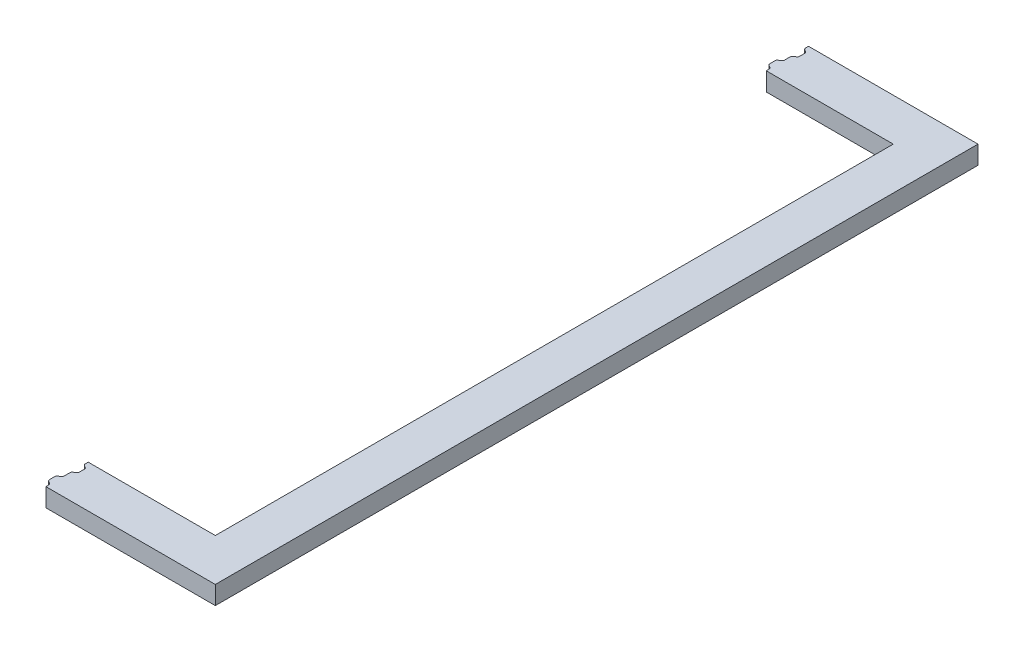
ISO-10303-21;
HEADER;
FILE_DESCRIPTION(('STEP AP214'),'2;1');
FILE_NAME('part.step','',(''),(''),'','','');
FILE_SCHEMA(('AUTOMOTIVE_DESIGN { 1 0 10303 214 1 1 1 1 }'));
ENDSEC;
DATA;
#1=APPLICATION_CONTEXT('core data for automotive mechanical design processes');
#2=APPLICATION_PROTOCOL_DEFINITION('international standard','automotive_design',2000,#1);
#3=PRODUCT_CONTEXT('',#1,'mechanical');
#4=PRODUCT('Part','Part','',(#3));
#5=PRODUCT_RELATED_PRODUCT_CATEGORY('part','',(#4));
#6=PRODUCT_DEFINITION_FORMATION('','',#4);
#7=PRODUCT_DEFINITION_CONTEXT('part definition',#1,'design');
#8=PRODUCT_DEFINITION('design','',#6,#7);
#9=PRODUCT_DEFINITION_SHAPE('','',#8);
#10=(LENGTH_UNIT() NAMED_UNIT(*) SI_UNIT(.MILLI.,.METRE.));
#11=(NAMED_UNIT(*) PLANE_ANGLE_UNIT() SI_UNIT($,.RADIAN.));
#12=(NAMED_UNIT(*) SI_UNIT($,.STERADIAN.) SOLID_ANGLE_UNIT());
#13=UNCERTAINTY_MEASURE_WITH_UNIT(LENGTH_MEASURE(1.E-05),#10,'distance_accuracy_value','');
#14=(GEOMETRIC_REPRESENTATION_CONTEXT(3) GLOBAL_UNCERTAINTY_ASSIGNED_CONTEXT((#13)) GLOBAL_UNIT_ASSIGNED_CONTEXT((#10,
#11,#12)) REPRESENTATION_CONTEXT('',''));
#15=CARTESIAN_POINT('',(0.,0.,0.));
#16=DIRECTION('',(0.,0.,1.));
#17=DIRECTION('',(1.,0.,0.));
#18=AXIS2_PLACEMENT_3D('',#15,#16,#17);
#19=CARTESIAN_POINT('',(0.200000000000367,13.,480.2));
#20=DIRECTION('',(0.,-1.,0.));
#21=DIRECTION('',(0.,0.,-1.));
#22=AXIS2_PLACEMENT_3D('',#19,#20,#21);
#23=CYLINDRICAL_SURFACE('',#22,0.200000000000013);
#24=CARTESIAN_POINT('',(0.200000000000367,0.,480.2));
#25=DIRECTION('',(0.,1.,0.));
#26=DIRECTION('',(0.,0.,-1.));
#27=AXIS2_PLACEMENT_3D('',#24,#25,#26);
#28=CIRCLE('',#27,0.200000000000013);
#29=CARTESIAN_POINT('',(0.200000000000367,0.,480.));
#30=VERTEX_POINT('',#29);
#31=CARTESIAN_POINT('',(3.7470027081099E-13,0.,480.2));
#32=VERTEX_POINT('',#31);
#33=EDGE_CURVE('E310',#30,#32,#28,.T.);
#34=ORIENTED_EDGE('',*,*,#33,.T.);
#35=DIRECTION('',(0.,-1.,0.));
#36=VECTOR('',#35,1.);
#37=CARTESIAN_POINT('',(3.7470027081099E-13,13.,480.2));
#38=LINE('',#37,#36);
#39=CARTESIAN_POINT('',(3.7470027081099E-13,13.,480.2));
#40=VERTEX_POINT('',#39);
#41=EDGE_CURVE('E11',#40,#32,#38,.T.);
#42=ORIENTED_EDGE('',*,*,#41,.F.);
#43=CARTESIAN_POINT('',(0.200000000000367,13.,480.2));
#44=DIRECTION('',(0.,1.,0.));
#45=DIRECTION('',(0.,0.,-1.));
#46=AXIS2_PLACEMENT_3D('',#43,#44,#45);
#47=CIRCLE('',#46,0.200000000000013);
#48=CARTESIAN_POINT('',(0.200000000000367,13.,480.));
#49=VERTEX_POINT('',#48);
#50=EDGE_CURVE('E409',#49,#40,#47,.T.);
#51=ORIENTED_EDGE('',*,*,#50,.F.);
#52=DIRECTION('',(0.,-1.,0.));
#53=VECTOR('',#52,1.);
#54=CARTESIAN_POINT('',(0.200000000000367,13.,480.));
#55=LINE('',#54,#53);
#56=EDGE_CURVE('E323',#49,#30,#55,.T.);
#57=ORIENTED_EDGE('',*,*,#56,.T.);
#58=EDGE_LOOP('',(#34,#42,#51,#57));
#59=FACE_BOUND('',#58,.T.);
#60=ADVANCED_FACE('F26',(#59),#23,.T.);
#61=CARTESIAN_POINT('',(3.7470027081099E-13,13.,480.2));
#62=DIRECTION('',(1.,0.,0.));
#63=DIRECTION('',(0.,0.,-1.));
#64=AXIS2_PLACEMENT_3D('',#61,#62,#63);
#65=PLANE('',#64);
#66=DIRECTION('',(0.,0.,1.));
#67=VECTOR('',#66,1.);
#68=CARTESIAN_POINT('',(3.7470027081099E-13,0.,480.2));
#69=LINE('',#68,#67);
#70=CARTESIAN_POINT('',(3.60822483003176E-13,0.,482.076239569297));
#71=VERTEX_POINT('',#70);
#72=EDGE_CURVE('E306',#32,#71,#69,.T.);
#73=ORIENTED_EDGE('',*,*,#72,.T.);
#74=DIRECTION('',(0.,-1.,0.));
#75=VECTOR('',#74,1.);
#76=CARTESIAN_POINT('',(3.60822483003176E-13,13.,482.076239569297));
#77=LINE('',#76,#75);
#78=CARTESIAN_POINT('',(3.60822483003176E-13,13.,482.076239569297));
#79=VERTEX_POINT('',#78);
#80=EDGE_CURVE('E33',#79,#71,#77,.T.);
#81=ORIENTED_EDGE('',*,*,#80,.F.);
#82=DIRECTION('',(0.,0.,1.));
#83=VECTOR('',#82,1.);
#84=CARTESIAN_POINT('',(3.7470027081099E-13,13.,480.2));
#85=LINE('',#84,#83);
#86=EDGE_CURVE('E319',#40,#79,#85,.T.);
#87=ORIENTED_EDGE('',*,*,#86,.F.);
#88=ORIENTED_EDGE('',*,*,#41,.T.);
#89=EDGE_LOOP('',(#73,#81,#87,#88));
#90=FACE_BOUND('',#89,.T.);
#91=ADVANCED_FACE('F318',(#90),#65,.F.);
#92=CARTESIAN_POINT('',(1.60000000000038,13.,482.076239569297));
#93=DIRECTION('',(0.,-1.,0.));
#94=DIRECTION('',(0.,0.,-1.));
#95=AXIS2_PLACEMENT_3D('',#92,#93,#94);
#96=CYLINDRICAL_SURFACE('',#95,1.59999999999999);
#97=CARTESIAN_POINT('',(1.60000000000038,0.,482.076239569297));
#98=DIRECTION('',(0.,1.,0.));
#99=DIRECTION('',(0.,0.,1.));
#100=AXIS2_PLACEMENT_3D('',#97,#98,#99);
#101=CIRCLE('',#100,1.59999999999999);
#102=CARTESIAN_POINT('',(0.800000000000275,0.,483.461880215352));
#103=VERTEX_POINT('',#102);
#104=EDGE_CURVE('E312',#71,#103,#101,.T.);
#105=ORIENTED_EDGE('',*,*,#104,.T.);
#106=DIRECTION('',(0.,-1.,0.));
#107=VECTOR('',#106,1.);
#108=CARTESIAN_POINT('',(0.800000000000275,13.,483.461880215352));
#109=LINE('',#108,#107);
#110=CARTESIAN_POINT('',(0.800000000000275,13.,483.461880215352));
#111=VERTEX_POINT('',#110);
#112=EDGE_CURVE('E615',#111,#103,#109,.T.);
#113=ORIENTED_EDGE('',*,*,#112,.F.);
#114=CARTESIAN_POINT('',(1.60000000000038,13.,482.076239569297));
#115=DIRECTION('',(0.,1.,0.));
#116=DIRECTION('',(0.,0.,1.));
#117=AXIS2_PLACEMENT_3D('',#114,#115,#116);
#118=CIRCLE('',#117,1.59999999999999);
#119=EDGE_CURVE('E412',#79,#111,#118,.T.);
#120=ORIENTED_EDGE('',*,*,#119,.F.);
#121=ORIENTED_EDGE('',*,*,#80,.T.);
#122=EDGE_LOOP('',(#105,#113,#120,#121));
#123=FACE_BOUND('',#122,.T.);
#124=ADVANCED_FACE('F619',(#123),#96,.T.);
#125=CARTESIAN_POINT('',(0.8000000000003,13.,483.461880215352));
#126=DIRECTION('',(0.500000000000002,0.,-0.866025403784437));
#127=DIRECTION('',(-0.866025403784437,0.,-0.500000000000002));
#128=AXIS2_PLACEMENT_3D('',#125,#126,#127);
#129=PLANE('',#128);
#130=DIRECTION('',(0.866025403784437,0.,0.500000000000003));
#131=VECTOR('',#130,1.);
#132=CARTESIAN_POINT('',(0.8000000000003,0.,483.461880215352));
#133=LINE('',#132,#131);
#134=CARTESIAN_POINT('',(2.20000000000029,0.,484.270170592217));
#135=VERTEX_POINT('',#134);
#136=EDGE_CURVE('E327',#103,#135,#133,.T.);
#137=ORIENTED_EDGE('',*,*,#136,.T.);
#138=DIRECTION('',(0.,-1.,0.));
#139=VECTOR('',#138,1.);
#140=CARTESIAN_POINT('',(2.20000000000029,13.,484.270170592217));
#141=LINE('',#140,#139);
#142=CARTESIAN_POINT('',(2.20000000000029,13.,484.270170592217));
#143=VERTEX_POINT('',#142);
#144=EDGE_CURVE('E612',#143,#135,#141,.T.);
#145=ORIENTED_EDGE('',*,*,#144,.F.);
#146=DIRECTION('',(0.866025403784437,0.,0.500000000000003));
#147=VECTOR('',#146,1.);
#148=CARTESIAN_POINT('',(0.8000000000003,13.,483.461880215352));
#149=LINE('',#148,#147);
#150=EDGE_CURVE('E414',#111,#143,#149,.T.);
#151=ORIENTED_EDGE('',*,*,#150,.F.);
#152=ORIENTED_EDGE('',*,*,#112,.T.);
#153=EDGE_LOOP('',(#137,#145,#151,#152));
#154=FACE_BOUND('',#153,.T.);
#155=ADVANCED_FACE('F627',(#154),#129,.F.);
#156=CARTESIAN_POINT('',(1.40000000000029,13.,485.655811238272));
#157=DIRECTION('',(0.,-1.,0.));
#158=DIRECTION('',(0.,0.,-1.));
#159=AXIS2_PLACEMENT_3D('',#156,#157,#158);
#160=CYLINDRICAL_SURFACE('',#159,1.60000000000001);
#161=CARTESIAN_POINT('',(1.40000000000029,0.,485.655811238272));
#162=DIRECTION('',(0.,-1.,0.));
#163=DIRECTION('',(0.,0.,-1.));
#164=AXIS2_PLACEMENT_3D('',#161,#162,#163);
#165=CIRCLE('',#164,1.60000000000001);
#166=CARTESIAN_POINT('',(3.0000000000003,0.,485.655811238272));
#167=VERTEX_POINT('',#166);
#168=EDGE_CURVE('E329',#135,#167,#165,.T.);
#169=ORIENTED_EDGE('',*,*,#168,.T.);
#170=DIRECTION('',(0.,-1.,0.));
#171=VECTOR('',#170,1.);
#172=CARTESIAN_POINT('',(3.0000000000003,13.,485.655811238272));
#173=LINE('',#172,#171);
#174=CARTESIAN_POINT('',(3.0000000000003,13.,485.655811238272));
#175=VERTEX_POINT('',#174);
#176=EDGE_CURVE('E609',#175,#167,#173,.T.);
#177=ORIENTED_EDGE('',*,*,#176,.F.);
#178=CARTESIAN_POINT('',(1.40000000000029,13.,485.655811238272));
#179=DIRECTION('',(0.,-1.,0.));
#180=DIRECTION('',(0.,0.,-1.));
#181=AXIS2_PLACEMENT_3D('',#178,#179,#180);
#182=CIRCLE('',#181,1.60000000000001);
#183=EDGE_CURVE('E416',#143,#175,#182,.T.);
#184=ORIENTED_EDGE('',*,*,#183,.F.);
#185=ORIENTED_EDGE('',*,*,#144,.T.);
#186=EDGE_LOOP('',(#169,#177,#184,#185));
#187=FACE_BOUND('',#186,.T.);
#188=ADVANCED_FACE('F630',(#187),#160,.F.);
#189=CARTESIAN_POINT('',(3.0000000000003,13.,485.655811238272));
#190=DIRECTION('',(1.,0.,0.));
#191=DIRECTION('',(0.,0.,-1.));
#192=AXIS2_PLACEMENT_3D('',#189,#190,#191);
#193=PLANE('',#192);
#194=DIRECTION('',(0.,0.,1.));
#195=VECTOR('',#194,1.);
#196=CARTESIAN_POINT('',(3.0000000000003,0.,485.655811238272));
#197=LINE('',#196,#195);
#198=CARTESIAN_POINT('',(3.0000000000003,0.,489.339621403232));
#199=VERTEX_POINT('',#198);
#200=EDGE_CURVE('E331',#167,#199,#197,.T.);
#201=ORIENTED_EDGE('',*,*,#200,.T.);
#202=DIRECTION('',(0.,-1.,0.));
#203=VECTOR('',#202,1.);
#204=CARTESIAN_POINT('',(3.0000000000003,13.,489.339621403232));
#205=LINE('',#204,#203);
#206=CARTESIAN_POINT('',(3.0000000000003,13.,489.339621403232));
#207=VERTEX_POINT('',#206);
#208=EDGE_CURVE('E606',#207,#199,#205,.T.);
#209=ORIENTED_EDGE('',*,*,#208,.F.);
#210=DIRECTION('',(0.,0.,1.));
#211=VECTOR('',#210,1.);
#212=CARTESIAN_POINT('',(3.0000000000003,13.,485.655811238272));
#213=LINE('',#212,#211);
#214=EDGE_CURVE('E418',#175,#207,#213,.T.);
#215=ORIENTED_EDGE('',*,*,#214,.F.);
#216=ORIENTED_EDGE('',*,*,#176,.T.);
#217=EDGE_LOOP('',(#201,#209,#215,#216));
#218=FACE_BOUND('',#217,.T.);
#219=ADVANCED_FACE('F635',(#218),#193,.F.);
#220=CARTESIAN_POINT('',(1.40000000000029,13.,489.339621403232));
#221=DIRECTION('',(0.,-1.,0.));
#222=DIRECTION('',(0.,0.,-1.));
#223=AXIS2_PLACEMENT_3D('',#220,#221,#222);
#224=CYLINDRICAL_SURFACE('',#223,1.60000000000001);
#225=CARTESIAN_POINT('',(1.40000000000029,0.,489.339621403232));
#226=DIRECTION('',(0.,-1.,0.));
#227=DIRECTION('',(0.,0.,-1.));
#228=AXIS2_PLACEMENT_3D('',#225,#226,#227);
#229=CIRCLE('',#228,1.60000000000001);
#230=CARTESIAN_POINT('',(2.20215355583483,0.,490.724016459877));
#231=VERTEX_POINT('',#230);
#232=EDGE_CURVE('E333',#199,#231,#229,.T.);
#233=ORIENTED_EDGE('',*,*,#232,.T.);
#234=DIRECTION('',(0.,-1.,0.));
#235=VECTOR('',#234,1.);
#236=CARTESIAN_POINT('',(2.20215355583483,13.,490.724016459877));
#237=LINE('',#236,#235);
#238=CARTESIAN_POINT('',(2.20215355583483,13.,490.724016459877));
#239=VERTEX_POINT('',#238);
#240=EDGE_CURVE('E603',#239,#231,#237,.T.);
#241=ORIENTED_EDGE('',*,*,#240,.F.);
#242=CARTESIAN_POINT('',(1.40000000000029,13.,489.339621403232));
#243=DIRECTION('',(0.,-1.,0.));
#244=DIRECTION('',(0.,0.,-1.));
#245=AXIS2_PLACEMENT_3D('',#242,#243,#244);
#246=CIRCLE('',#245,1.60000000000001);
#247=EDGE_CURVE('E420',#207,#239,#246,.T.);
#248=ORIENTED_EDGE('',*,*,#247,.F.);
#249=ORIENTED_EDGE('',*,*,#208,.T.);
#250=EDGE_LOOP('',(#233,#241,#248,#249));
#251=FACE_BOUND('',#250,.T.);
#252=ADVANCED_FACE('F641',(#251),#224,.F.);
#253=CARTESIAN_POINT('',(2.20215355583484,13.,490.724016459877));
#254=DIRECTION('',(0.501345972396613,0.,0.86524691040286));
#255=DIRECTION('',(0.86524691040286,0.,-0.501345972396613));
#256=AXIS2_PLACEMENT_3D('',#253,#254,#255);
#257=PLANE('',#256);
#258=DIRECTION('',(-0.86524691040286,0.,0.501345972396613));
#259=VECTOR('',#258,1.);
#260=CARTESIAN_POINT('',(2.20215355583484,0.,490.724016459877));
#261=LINE('',#260,#259);
#262=CARTESIAN_POINT('',(0.797846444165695,0.,491.537707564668));
#263=VERTEX_POINT('',#262);
#264=EDGE_CURVE('E335',#231,#263,#261,.T.);
#265=ORIENTED_EDGE('',*,*,#264,.T.);
#266=DIRECTION('',(0.,-1.,0.));
#267=VECTOR('',#266,1.);
#268=CARTESIAN_POINT('',(0.797846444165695,13.,491.537707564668));
#269=LINE('',#268,#267);
#270=CARTESIAN_POINT('',(0.797846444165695,13.,491.537707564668));
#271=VERTEX_POINT('',#270);
#272=EDGE_CURVE('E600',#271,#263,#269,.T.);
#273=ORIENTED_EDGE('',*,*,#272,.F.);
#274=DIRECTION('',(-0.86524691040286,0.,0.501345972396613));
#275=VECTOR('',#274,1.);
#276=CARTESIAN_POINT('',(2.20215355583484,13.,490.724016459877));
#277=LINE('',#276,#275);
#278=EDGE_CURVE('E422',#239,#271,#277,.T.);
#279=ORIENTED_EDGE('',*,*,#278,.F.);
#280=ORIENTED_EDGE('',*,*,#240,.T.);
#281=EDGE_LOOP('',(#265,#273,#279,#280));
#282=FACE_BOUND('',#281,.T.);
#283=ADVANCED_FACE('F645',(#282),#257,.F.);
#284=CARTESIAN_POINT('',(1.60000000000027,13.,492.922102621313));
#285=DIRECTION('',(0.,-1.,0.));
#286=DIRECTION('',(0.,0.,-1.));
#287=AXIS2_PLACEMENT_3D('',#284,#285,#286);
#288=CYLINDRICAL_SURFACE('',#287,1.59999999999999);
#289=CARTESIAN_POINT('',(1.60000000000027,0.,492.922102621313));
#290=DIRECTION('',(0.,1.,0.));
#291=DIRECTION('',(0.,0.,1.));
#292=AXIS2_PLACEMENT_3D('',#289,#290,#291);
#293=CIRCLE('',#292,1.59999999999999);
#294=CARTESIAN_POINT('',(2.81458883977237E-13,0.,492.922102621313));
#295=VERTEX_POINT('',#294);
#296=EDGE_CURVE('E337',#263,#295,#293,.T.);
#297=ORIENTED_EDGE('',*,*,#296,.T.);
#298=DIRECTION('',(0.,-1.,0.));
#299=VECTOR('',#298,1.);
#300=CARTESIAN_POINT('',(2.81458883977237E-13,13.,492.922102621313));
#301=LINE('',#300,#299);
#302=CARTESIAN_POINT('',(2.81458883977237E-13,13.,492.922102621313));
#303=VERTEX_POINT('',#302);
#304=EDGE_CURVE('E597',#303,#295,#301,.T.);
#305=ORIENTED_EDGE('',*,*,#304,.F.);
#306=CARTESIAN_POINT('',(1.60000000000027,13.,492.922102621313));
#307=DIRECTION('',(0.,1.,0.));
#308=DIRECTION('',(0.,0.,1.));
#309=AXIS2_PLACEMENT_3D('',#306,#307,#308);
#310=CIRCLE('',#309,1.59999999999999);
#311=EDGE_CURVE('E424',#271,#303,#310,.T.);
#312=ORIENTED_EDGE('',*,*,#311,.F.);
#313=ORIENTED_EDGE('',*,*,#272,.T.);
#314=EDGE_LOOP('',(#297,#305,#312,#313));
#315=FACE_BOUND('',#314,.T.);
#316=ADVANCED_FACE('F650',(#315),#288,.T.);
#317=CARTESIAN_POINT('',(2.77555756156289E-13,13.,492.922102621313));
#318=DIRECTION('',(1.,0.,0.));
#319=DIRECTION('',(0.,0.,-1.));
#320=AXIS2_PLACEMENT_3D('',#317,#318,#319);
#321=PLANE('',#320);
#322=DIRECTION('',(0.,0.,1.));
#323=VECTOR('',#322,1.);
#324=CARTESIAN_POINT('',(2.77555756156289E-13,0.,492.922102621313));
#325=LINE('',#324,#323);
#326=CARTESIAN_POINT('',(2.77555756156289E-13,0.,497.077897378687));
#327=VERTEX_POINT('',#326);
#328=EDGE_CURVE('E339',#295,#327,#325,.T.);
#329=ORIENTED_EDGE('',*,*,#328,.T.);
#330=DIRECTION('',(0.,-1.,0.));
#331=VECTOR('',#330,1.);
#332=CARTESIAN_POINT('',(2.77555756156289E-13,13.,497.077897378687));
#333=LINE('',#332,#331);
#334=CARTESIAN_POINT('',(2.77555756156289E-13,13.,497.077897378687));
#335=VERTEX_POINT('',#334);
#336=EDGE_CURVE('E594',#335,#327,#333,.T.);
#337=ORIENTED_EDGE('',*,*,#336,.F.);
#338=DIRECTION('',(0.,0.,1.));
#339=VECTOR('',#338,1.);
#340=CARTESIAN_POINT('',(2.77555756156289E-13,13.,492.922102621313));
#341=LINE('',#340,#339);
#342=EDGE_CURVE('E426',#303,#335,#341,.T.);
#343=ORIENTED_EDGE('',*,*,#342,.F.);
#344=ORIENTED_EDGE('',*,*,#304,.T.);
#345=EDGE_LOOP('',(#329,#337,#343,#344));
#346=FACE_BOUND('',#345,.T.);
#347=ADVANCED_FACE('F656',(#346),#321,.F.);
#348=CARTESIAN_POINT('',(-1.59999999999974,13.,497.077897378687));
#349=DIRECTION('',(0.,-1.,0.));
#350=DIRECTION('',(0.,0.,-1.));
#351=AXIS2_PLACEMENT_3D('',#348,#349,#350);
#352=CYLINDRICAL_SURFACE('',#351,1.60000000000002);
#353=CARTESIAN_POINT('',(-1.59999999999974,0.,497.077897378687));
#354=DIRECTION('',(0.,-1.,0.));
#355=DIRECTION('',(0.,0.,1.));
#356=AXIS2_PLACEMENT_3D('',#353,#354,#355);
#357=CIRCLE('',#356,1.60000000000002);
#358=CARTESIAN_POINT('',(-0.797846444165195,0.,498.462292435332));
#359=VERTEX_POINT('',#358);
#360=EDGE_CURVE('E341',#327,#359,#357,.T.);
#361=ORIENTED_EDGE('',*,*,#360,.T.);
#362=DIRECTION('',(0.,-1.,0.));
#363=VECTOR('',#362,1.);
#364=CARTESIAN_POINT('',(-0.797846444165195,13.,498.462292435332));
#365=LINE('',#364,#363);
#366=CARTESIAN_POINT('',(-0.797846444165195,13.,498.462292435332));
#367=VERTEX_POINT('',#366);
#368=EDGE_CURVE('E591',#367,#359,#365,.T.);
#369=ORIENTED_EDGE('',*,*,#368,.F.);
#370=CARTESIAN_POINT('',(-1.59999999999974,13.,497.077897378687));
#371=DIRECTION('',(0.,-1.,0.));
#372=DIRECTION('',(0.,0.,1.));
#373=AXIS2_PLACEMENT_3D('',#370,#371,#372);
#374=CIRCLE('',#373,1.60000000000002);
#375=EDGE_CURVE('E428',#335,#367,#374,.T.);
#376=ORIENTED_EDGE('',*,*,#375,.F.);
#377=ORIENTED_EDGE('',*,*,#336,.T.);
#378=EDGE_LOOP('',(#361,#369,#376,#377));
#379=FACE_BOUND('',#378,.T.);
#380=ADVANCED_FACE('F660',(#379),#352,.F.);
#381=CARTESIAN_POINT('',(-2.20215355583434,13.,499.275983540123));
#382=DIRECTION('',(0.501345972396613,0.,0.86524691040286));
#383=DIRECTION('',(0.86524691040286,0.,-0.501345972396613));
#384=AXIS2_PLACEMENT_3D('',#381,#382,#383);
#385=PLANE('',#384);
#386=DIRECTION('',(-0.86524691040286,0.,0.501345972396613));
#387=VECTOR('',#386,1.);
#388=CARTESIAN_POINT('',(-2.20215355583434,0.,499.275983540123));
#389=LINE('',#388,#387);
#390=CARTESIAN_POINT('',(-2.20215355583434,0.,499.275983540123));
#391=VERTEX_POINT('',#390);
#392=EDGE_CURVE('E343',#359,#391,#389,.T.);
#393=ORIENTED_EDGE('',*,*,#392,.T.);
#394=DIRECTION('',(0.,-1.,0.));
#395=VECTOR('',#394,1.);
#396=CARTESIAN_POINT('',(-2.20215355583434,13.,499.275983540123));
#397=LINE('',#396,#395);
#398=CARTESIAN_POINT('',(-2.20215355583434,13.,499.275983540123));
#399=VERTEX_POINT('',#398);
#400=EDGE_CURVE('E588',#399,#391,#397,.T.);
#401=ORIENTED_EDGE('',*,*,#400,.F.);
#402=DIRECTION('',(-0.86524691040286,0.,0.501345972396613));
#403=VECTOR('',#402,1.);
#404=CARTESIAN_POINT('',(-2.20215355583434,13.,499.275983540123));
#405=LINE('',#404,#403);
#406=EDGE_CURVE('E430',#367,#399,#405,.T.);
#407=ORIENTED_EDGE('',*,*,#406,.F.);
#408=ORIENTED_EDGE('',*,*,#368,.T.);
#409=EDGE_LOOP('',(#393,#401,#407,#408));
#410=FACE_BOUND('',#409,.T.);
#411=ADVANCED_FACE('F665',(#410),#385,.F.);
#412=CARTESIAN_POINT('',(-1.39999999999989,13.,500.660378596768));
#413=DIRECTION('',(0.,-1.,0.));
#414=DIRECTION('',(0.,0.,-1.));
#415=AXIS2_PLACEMENT_3D('',#412,#413,#414);
#416=CYLINDRICAL_SURFACE('',#415,1.60000000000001);
#417=CARTESIAN_POINT('',(-1.39999999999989,0.,500.660378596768));
#418=DIRECTION('',(0.,1.,0.));
#419=DIRECTION('',(0.,0.,-1.));
#420=AXIS2_PLACEMENT_3D('',#417,#418,#419);
#421=CIRCLE('',#420,1.60000000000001);
#422=CARTESIAN_POINT('',(-2.9999999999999,0.,500.660378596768));
#423=VERTEX_POINT('',#422);
#424=EDGE_CURVE('E345',#391,#423,#421,.T.);
#425=ORIENTED_EDGE('',*,*,#424,.T.);
#426=DIRECTION('',(0.,-1.,0.));
#427=VECTOR('',#426,1.);
#428=CARTESIAN_POINT('',(-2.9999999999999,13.,500.660378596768));
#429=LINE('',#428,#427);
#430=CARTESIAN_POINT('',(-2.9999999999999,13.,500.660378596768));
#431=VERTEX_POINT('',#430);
#432=EDGE_CURVE('E585',#431,#423,#429,.T.);
#433=ORIENTED_EDGE('',*,*,#432,.F.);
#434=CARTESIAN_POINT('',(-1.39999999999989,13.,500.660378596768));
#435=DIRECTION('',(0.,1.,0.));
#436=DIRECTION('',(0.,0.,-1.));
#437=AXIS2_PLACEMENT_3D('',#434,#435,#436);
#438=CIRCLE('',#437,1.60000000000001);
#439=EDGE_CURVE('E432',#399,#431,#438,.T.);
#440=ORIENTED_EDGE('',*,*,#439,.F.);
#441=ORIENTED_EDGE('',*,*,#400,.T.);
#442=EDGE_LOOP('',(#425,#433,#440,#441));
#443=FACE_BOUND('',#442,.T.);
#444=ADVANCED_FACE('F671',(#443),#416,.T.);
#445=CARTESIAN_POINT('',(-2.99999999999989,13.,504.344188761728));
#446=DIRECTION('',(1.,0.,0.));
#447=DIRECTION('',(0.,0.,-1.));
#448=AXIS2_PLACEMENT_3D('',#445,#446,#447);
#449=PLANE('',#448);
#450=DIRECTION('',(0.,0.,1.));
#451=VECTOR('',#450,1.);
#452=CARTESIAN_POINT('',(-2.99999999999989,0.,504.344188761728));
#453=LINE('',#452,#451);
#454=CARTESIAN_POINT('',(-2.99999999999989,0.,504.344188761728));
#455=VERTEX_POINT('',#454);
#456=EDGE_CURVE('E347',#423,#455,#453,.T.);
#457=ORIENTED_EDGE('',*,*,#456,.T.);
#458=DIRECTION('',(0.,-1.,0.));
#459=VECTOR('',#458,1.);
#460=CARTESIAN_POINT('',(-2.99999999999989,13.,504.344188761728));
#461=LINE('',#460,#459);
#462=CARTESIAN_POINT('',(-2.99999999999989,13.,504.344188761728));
#463=VERTEX_POINT('',#462);
#464=EDGE_CURVE('E582',#463,#455,#461,.T.);
#465=ORIENTED_EDGE('',*,*,#464,.F.);
#466=DIRECTION('',(0.,0.,1.));
#467=VECTOR('',#466,1.);
#468=CARTESIAN_POINT('',(-2.99999999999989,13.,504.344188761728));
#469=LINE('',#468,#467);
#470=EDGE_CURVE('E434',#431,#463,#469,.T.);
#471=ORIENTED_EDGE('',*,*,#470,.F.);
#472=ORIENTED_EDGE('',*,*,#432,.T.);
#473=EDGE_LOOP('',(#457,#465,#471,#472));
#474=FACE_BOUND('',#473,.T.);
#475=ADVANCED_FACE('F675',(#474),#449,.F.);
#476=CARTESIAN_POINT('',(-1.3999999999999,13.,504.344188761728));
#477=DIRECTION('',(0.,-1.,0.));
#478=DIRECTION('',(0.,0.,-1.));
#479=AXIS2_PLACEMENT_3D('',#476,#477,#478);
#480=CYLINDRICAL_SURFACE('',#479,1.6);
#481=CARTESIAN_POINT('',(-1.3999999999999,0.,504.344188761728));
#482=DIRECTION('',(0.,1.,0.));
#483=DIRECTION('',(0.,0.,-1.));
#484=AXIS2_PLACEMENT_3D('',#481,#482,#483);
#485=CIRCLE('',#484,1.6);
#486=CARTESIAN_POINT('',(-2.19999999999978,0.,505.729829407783));
#487=VERTEX_POINT('',#486);
#488=EDGE_CURVE('E349',#455,#487,#485,.T.);
#489=ORIENTED_EDGE('',*,*,#488,.T.);
#490=DIRECTION('',(0.,-1.,0.));
#491=VECTOR('',#490,1.);
#492=CARTESIAN_POINT('',(-2.19999999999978,13.,505.729829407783));
#493=LINE('',#492,#491);
#494=CARTESIAN_POINT('',(-2.19999999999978,13.,505.729829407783));
#495=VERTEX_POINT('',#494);
#496=EDGE_CURVE('E579',#495,#487,#493,.T.);
#497=ORIENTED_EDGE('',*,*,#496,.F.);
#498=CARTESIAN_POINT('',(-1.3999999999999,13.,504.344188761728));
#499=DIRECTION('',(0.,1.,0.));
#500=DIRECTION('',(0.,0.,-1.));
#501=AXIS2_PLACEMENT_3D('',#498,#499,#500);
#502=CIRCLE('',#501,1.6);
#503=EDGE_CURVE('E436',#463,#495,#502,.T.);
#504=ORIENTED_EDGE('',*,*,#503,.F.);
#505=ORIENTED_EDGE('',*,*,#464,.T.);
#506=EDGE_LOOP('',(#489,#497,#504,#505));
#507=FACE_BOUND('',#506,.T.);
#508=ADVANCED_FACE('F680',(#507),#480,.T.);
#509=CARTESIAN_POINT('',(-0.799999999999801,13.,506.538119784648));
#510=DIRECTION('',(0.500000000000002,0.,-0.866025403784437));
#511=DIRECTION('',(-0.866025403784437,0.,-0.500000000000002));
#512=AXIS2_PLACEMENT_3D('',#509,#510,#511);
#513=PLANE('',#512);
#514=DIRECTION('',(0.866025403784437,0.,0.500000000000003));
#515=VECTOR('',#514,1.);
#516=CARTESIAN_POINT('',(-0.799999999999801,0.,506.538119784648));
#517=LINE('',#516,#515);
#518=CARTESIAN_POINT('',(-0.799999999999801,0.,506.538119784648));
#519=VERTEX_POINT('',#518);
#520=EDGE_CURVE('E351',#487,#519,#517,.T.);
#521=ORIENTED_EDGE('',*,*,#520,.T.);
#522=DIRECTION('',(0.,-1.,0.));
#523=VECTOR('',#522,1.);
#524=CARTESIAN_POINT('',(-0.799999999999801,13.,506.538119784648));
#525=LINE('',#524,#523);
#526=CARTESIAN_POINT('',(-0.799999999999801,13.,506.538119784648));
#527=VERTEX_POINT('',#526);
#528=EDGE_CURVE('E576',#527,#519,#525,.T.);
#529=ORIENTED_EDGE('',*,*,#528,.F.);
#530=DIRECTION('',(0.866025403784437,0.,0.500000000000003));
#531=VECTOR('',#530,1.);
#532=CARTESIAN_POINT('',(-0.799999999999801,13.,506.538119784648));
#533=LINE('',#532,#531);
#534=EDGE_CURVE('E438',#495,#527,#533,.T.);
#535=ORIENTED_EDGE('',*,*,#534,.F.);
#536=ORIENTED_EDGE('',*,*,#496,.T.);
#537=EDGE_LOOP('',(#521,#529,#535,#536));
#538=FACE_BOUND('',#537,.T.);
#539=ADVANCED_FACE('F686',(#538),#513,.F.);
#540=CARTESIAN_POINT('',(-1.59999999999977,13.,507.923760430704));
#541=DIRECTION('',(0.,-1.,0.));
#542=DIRECTION('',(0.,0.,-1.));
#543=AXIS2_PLACEMENT_3D('',#540,#541,#542);
#544=CYLINDRICAL_SURFACE('',#543,1.59999999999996);
#545=CARTESIAN_POINT('',(-1.59999999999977,0.,507.923760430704));
#546=DIRECTION('',(0.,-1.,0.));
#547=DIRECTION('',(0.,0.,1.));
#548=AXIS2_PLACEMENT_3D('',#545,#546,#547);
#549=CIRCLE('',#548,1.59999999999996);
#550=CARTESIAN_POINT('',(1.88434337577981E-13,0.,507.923760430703));
#551=VERTEX_POINT('',#550);
#552=EDGE_CURVE('E353',#519,#551,#549,.T.);
#553=ORIENTED_EDGE('',*,*,#552,.T.);
#554=DIRECTION('',(0.,-1.,0.));
#555=VECTOR('',#554,1.);
#556=CARTESIAN_POINT('',(1.88434337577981E-13,13.,507.923760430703));
#557=LINE('',#556,#555);
#558=CARTESIAN_POINT('',(1.88434337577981E-13,13.,507.923760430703));
#559=VERTEX_POINT('',#558);
#560=EDGE_CURVE('E573',#559,#551,#557,.T.);
#561=ORIENTED_EDGE('',*,*,#560,.F.);
#562=CARTESIAN_POINT('',(-1.59999999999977,13.,507.923760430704));
#563=DIRECTION('',(0.,-1.,0.));
#564=DIRECTION('',(0.,0.,1.));
#565=AXIS2_PLACEMENT_3D('',#562,#563,#564);
#566=CIRCLE('',#565,1.59999999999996);
#567=EDGE_CURVE('E440',#527,#559,#566,.T.);
#568=ORIENTED_EDGE('',*,*,#567,.F.);
#569=ORIENTED_EDGE('',*,*,#528,.T.);
#570=EDGE_LOOP('',(#553,#561,#568,#569));
#571=FACE_BOUND('',#570,.T.);
#572=ADVANCED_FACE('F690',(#571),#544,.F.);
#573=CARTESIAN_POINT('',(2.08166817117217E-13,13.,509.8));
#574=DIRECTION('',(1.,0.,0.));
#575=DIRECTION('',(0.,0.,-1.));
#576=AXIS2_PLACEMENT_3D('',#573,#574,#575);
#577=PLANE('',#576);
#578=DIRECTION('',(0.,0.,1.));
#579=VECTOR('',#578,1.);
#580=CARTESIAN_POINT('',(2.08166817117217E-13,0.,509.8));
#581=LINE('',#580,#579);
#582=CARTESIAN_POINT('',(2.08166817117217E-13,0.,509.8));
#583=VERTEX_POINT('',#582);
#584=EDGE_CURVE('E355',#551,#583,#581,.T.);
#585=ORIENTED_EDGE('',*,*,#584,.T.);
#586=DIRECTION('',(0.,-1.,0.));
#587=VECTOR('',#586,1.);
#588=CARTESIAN_POINT('',(2.08166817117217E-13,13.,509.8));
#589=LINE('',#588,#587);
#590=CARTESIAN_POINT('',(2.08166817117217E-13,13.,509.8));
#591=VERTEX_POINT('',#590);
#592=EDGE_CURVE('E570',#591,#583,#589,.T.);
#593=ORIENTED_EDGE('',*,*,#592,.F.);
#594=DIRECTION('',(0.,0.,1.));
#595=VECTOR('',#594,1.);
#596=CARTESIAN_POINT('',(2.08166817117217E-13,13.,509.8));
#597=LINE('',#596,#595);
#598=EDGE_CURVE('E442',#559,#591,#597,.T.);
#599=ORIENTED_EDGE('',*,*,#598,.F.);
#600=ORIENTED_EDGE('',*,*,#560,.T.);
#601=EDGE_LOOP('',(#585,#593,#599,#600));
#602=FACE_BOUND('',#601,.T.);
#603=ADVANCED_FACE('F695',(#602),#577,.F.);
#604=CARTESIAN_POINT('',(0.2000000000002,13.,509.8));
#605=DIRECTION('',(0.,-1.,0.));
#606=DIRECTION('',(0.,0.,-1.));
#607=AXIS2_PLACEMENT_3D('',#604,#605,#606);
#608=CYLINDRICAL_SURFACE('',#607,0.199999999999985);
#609=CARTESIAN_POINT('',(0.2000000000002,0.,509.8));
#610=DIRECTION('',(0.,1.,0.));
#611=DIRECTION('',(0.,0.,1.));
#612=AXIS2_PLACEMENT_3D('',#609,#610,#611);
#613=CIRCLE('',#612,0.199999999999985);
#614=CARTESIAN_POINT('',(0.200000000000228,0.,510.));
#615=VERTEX_POINT('',#614);
#616=EDGE_CURVE('E357',#583,#615,#613,.T.);
#617=ORIENTED_EDGE('',*,*,#616,.T.);
#618=DIRECTION('',(0.,-1.,0.));
#619=VECTOR('',#618,1.);
#620=CARTESIAN_POINT('',(0.200000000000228,13.,510.));
#621=LINE('',#620,#619);
#622=CARTESIAN_POINT('',(0.200000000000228,13.,510.));
#623=VERTEX_POINT('',#622);
#624=EDGE_CURVE('E567',#623,#615,#621,.T.);
#625=ORIENTED_EDGE('',*,*,#624,.F.);
#626=CARTESIAN_POINT('',(0.2000000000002,13.,509.8));
#627=DIRECTION('',(0.,1.,0.));
#628=DIRECTION('',(0.,0.,1.));
#629=AXIS2_PLACEMENT_3D('',#626,#627,#628);
#630=CIRCLE('',#629,0.199999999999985);
#631=EDGE_CURVE('E444',#591,#623,#630,.T.);
#632=ORIENTED_EDGE('',*,*,#631,.F.);
#633=ORIENTED_EDGE('',*,*,#592,.T.);
#634=EDGE_LOOP('',(#617,#625,#632,#633));
#635=FACE_BOUND('',#634,.T.);
#636=ADVANCED_FACE('F701',(#635),#608,.T.);
#637=CARTESIAN_POINT('',(0.200000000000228,13.,510.));
#638=DIRECTION('',(0.,0.,-1.));
#639=DIRECTION('',(-1.,0.,0.));
#640=AXIS2_PLACEMENT_3D('',#637,#638,#639);
#641=PLANE('',#640);
#642=DIRECTION('',(1.,0.,0.));
#643=VECTOR('',#642,1.);
#644=CARTESIAN_POINT('',(0.200000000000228,0.,510.));
#645=LINE('',#644,#643);
#646=CARTESIAN_POINT('',(120.,0.,510.));
#647=VERTEX_POINT('',#646);
#648=EDGE_CURVE('E359',#615,#647,#645,.T.);
#649=ORIENTED_EDGE('',*,*,#648,.T.);
#650=DIRECTION('',(0.,-1.,0.));
#651=VECTOR('',#650,1.);
#652=CARTESIAN_POINT('',(120.,13.,510.));
#653=LINE('',#652,#651);
#654=CARTESIAN_POINT('',(120.,13.,510.));
#655=VERTEX_POINT('',#654);
#656=EDGE_CURVE('E564',#655,#647,#653,.T.);
#657=ORIENTED_EDGE('',*,*,#656,.F.);
#658=DIRECTION('',(1.,0.,0.));
#659=VECTOR('',#658,1.);
#660=CARTESIAN_POINT('',(0.200000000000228,13.,510.));
#661=LINE('',#660,#659);
#662=EDGE_CURVE('E446',#623,#655,#661,.T.);
#663=ORIENTED_EDGE('',*,*,#662,.F.);
#664=ORIENTED_EDGE('',*,*,#624,.T.);
#665=EDGE_LOOP('',(#649,#657,#663,#664));
#666=FACE_BOUND('',#665,.T.);
#667=ADVANCED_FACE('F705',(#666),#641,.F.);
#668=CARTESIAN_POINT('',(120.,13.,510.));
#669=DIRECTION('',(-1.,0.,0.));
#670=DIRECTION('',(0.,0.,1.));
#671=AXIS2_PLACEMENT_3D('',#668,#669,#670);
#672=PLANE('',#671);
#673=DIRECTION('',(0.,0.,-1.));
#674=VECTOR('',#673,1.);
#675=CARTESIAN_POINT('',(120.,0.,510.));
#676=LINE('',#675,#674);
#677=CARTESIAN_POINT('',(120.,0.,-30.));
#678=VERTEX_POINT('',#677);
#679=EDGE_CURVE('E361',#647,#678,#676,.T.);
#680=ORIENTED_EDGE('',*,*,#679,.T.);
#681=DIRECTION('',(0.,-1.,0.));
#682=VECTOR('',#681,1.);
#683=CARTESIAN_POINT('',(120.,13.,-30.));
#684=LINE('',#683,#682);
#685=CARTESIAN_POINT('',(120.,13.,-30.));
#686=VERTEX_POINT('',#685);
#687=EDGE_CURVE('E561',#686,#678,#684,.T.);
#688=ORIENTED_EDGE('',*,*,#687,.F.);
#689=DIRECTION('',(0.,0.,-1.));
#690=VECTOR('',#689,1.);
#691=CARTESIAN_POINT('',(120.,13.,510.));
#692=LINE('',#691,#690);
#693=EDGE_CURVE('E448',#655,#686,#692,.T.);
#694=ORIENTED_EDGE('',*,*,#693,.F.);
#695=ORIENTED_EDGE('',*,*,#656,.T.);
#696=EDGE_LOOP('',(#680,#688,#694,#695));
#697=FACE_BOUND('',#696,.T.);
#698=ADVANCED_FACE('F710',(#697),#672,.F.);
#699=CARTESIAN_POINT('',(0.199999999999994,13.,-30.));
#700=DIRECTION('',(0.,0.,1.));
#701=DIRECTION('',(1.,0.,0.));
#702=AXIS2_PLACEMENT_3D('',#699,#700,#701);
#703=PLANE('',#702);
#704=DIRECTION('',(-1.,0.,0.));
#705=VECTOR('',#704,1.);
#706=CARTESIAN_POINT('',(0.199999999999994,0.,-30.));
#707=LINE('',#706,#705);
#708=CARTESIAN_POINT('',(0.199999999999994,0.,-30.));
#709=VERTEX_POINT('',#708);
#710=EDGE_CURVE('E363',#678,#709,#707,.T.);
#711=ORIENTED_EDGE('',*,*,#710,.T.);
#712=DIRECTION('',(0.,-1.,0.));
#713=VECTOR('',#712,1.);
#714=CARTESIAN_POINT('',(0.199999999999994,13.,-30.));
#715=LINE('',#714,#713);
#716=CARTESIAN_POINT('',(0.199999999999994,13.,-30.));
#717=VERTEX_POINT('',#716);
#718=EDGE_CURVE('E558',#717,#709,#715,.T.);
#719=ORIENTED_EDGE('',*,*,#718,.F.);
#720=DIRECTION('',(-1.,0.,0.));
#721=VECTOR('',#720,1.);
#722=CARTESIAN_POINT('',(0.199999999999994,13.,-30.));
#723=LINE('',#722,#721);
#724=EDGE_CURVE('E450',#686,#717,#723,.T.);
#725=ORIENTED_EDGE('',*,*,#724,.F.);
#726=ORIENTED_EDGE('',*,*,#687,.T.);
#727=EDGE_LOOP('',(#711,#719,#725,#726));
#728=FACE_BOUND('',#727,.T.);
#729=ADVANCED_FACE('F716',(#728),#703,.F.);
#730=CARTESIAN_POINT('',(0.199999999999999,13.,-29.8));
#731=DIRECTION('',(0.,-1.,0.));
#732=DIRECTION('',(0.,0.,-1.));
#733=AXIS2_PLACEMENT_3D('',#730,#731,#732);
#734=CYLINDRICAL_SURFACE('',#733,0.200000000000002);
#735=CARTESIAN_POINT('',(0.199999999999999,0.,-29.8));
#736=DIRECTION('',(0.,1.,0.));
#737=DIRECTION('',(0.,0.,-1.));
#738=AXIS2_PLACEMENT_3D('',#735,#736,#737);
#739=CIRCLE('',#738,0.200000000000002);
#740=CARTESIAN_POINT('',(0.,0.,-29.8));
#741=VERTEX_POINT('',#740);
#742=EDGE_CURVE('E365',#709,#741,#739,.T.);
#743=ORIENTED_EDGE('',*,*,#742,.T.);
#744=DIRECTION('',(0.,-1.,0.));
#745=VECTOR('',#744,1.);
#746=CARTESIAN_POINT('',(0.,13.,-29.8));
#747=LINE('',#746,#745);
#748=CARTESIAN_POINT('',(0.,13.,-29.8));
#749=VERTEX_POINT('',#748);
#750=EDGE_CURVE('E555',#749,#741,#747,.T.);
#751=ORIENTED_EDGE('',*,*,#750,.F.);
#752=CARTESIAN_POINT('',(0.199999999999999,13.,-29.8));
#753=DIRECTION('',(0.,1.,0.));
#754=DIRECTION('',(0.,0.,-1.));
#755=AXIS2_PLACEMENT_3D('',#752,#753,#754);
#756=CIRCLE('',#755,0.200000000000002);
#757=EDGE_CURVE('E452',#717,#749,#756,.T.);
#758=ORIENTED_EDGE('',*,*,#757,.F.);
#759=ORIENTED_EDGE('',*,*,#718,.T.);
#760=EDGE_LOOP('',(#743,#751,#758,#759));
#761=FACE_BOUND('',#760,.T.);
#762=ADVANCED_FACE('F720',(#761),#734,.T.);
#763=CARTESIAN_POINT('',(0.,13.,-29.8));
#764=DIRECTION('',(1.,0.,0.));
#765=DIRECTION('',(0.,0.,-1.));
#766=AXIS2_PLACEMENT_3D('',#763,#764,#765);
#767=PLANE('',#766);
#768=DIRECTION('',(0.,0.,1.));
#769=VECTOR('',#768,1.);
#770=CARTESIAN_POINT('',(0.,0.,-29.8));
#771=LINE('',#770,#769);
#772=CARTESIAN_POINT('',(0.,0.,-27.9237604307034));
#773=VERTEX_POINT('',#772);
#774=EDGE_CURVE('E367',#741,#773,#771,.T.);
#775=ORIENTED_EDGE('',*,*,#774,.T.);
#776=DIRECTION('',(0.,-1.,0.));
#777=VECTOR('',#776,1.);
#778=CARTESIAN_POINT('',(0.,13.,-27.9237604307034));
#779=LINE('',#778,#777);
#780=CARTESIAN_POINT('',(0.,13.,-27.9237604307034));
#781=VERTEX_POINT('',#780);
#782=EDGE_CURVE('E552',#781,#773,#779,.T.);
#783=ORIENTED_EDGE('',*,*,#782,.F.);
#784=DIRECTION('',(0.,0.,1.));
#785=VECTOR('',#784,1.);
#786=CARTESIAN_POINT('',(0.,13.,-29.8));
#787=LINE('',#786,#785);
#788=EDGE_CURVE('E454',#749,#781,#787,.T.);
#789=ORIENTED_EDGE('',*,*,#788,.F.);
#790=ORIENTED_EDGE('',*,*,#750,.T.);
#791=EDGE_LOOP('',(#775,#783,#789,#790));
#792=FACE_BOUND('',#791,.T.);
#793=ADVANCED_FACE('F725',(#792),#767,.F.);
#794=CARTESIAN_POINT('',(1.6,13.,-27.9237604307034));
#795=DIRECTION('',(0.,-1.,0.));
#796=DIRECTION('',(0.,0.,-1.));
#797=AXIS2_PLACEMENT_3D('',#794,#795,#796);
#798=CYLINDRICAL_SURFACE('',#797,1.60000000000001);
#799=CARTESIAN_POINT('',(1.6,0.,-27.9237604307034));
#800=DIRECTION('',(0.,1.,0.));
#801=DIRECTION('',(0.,0.,1.));
#802=AXIS2_PLACEMENT_3D('',#799,#800,#801);
#803=CIRCLE('',#802,1.60000000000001);
#804=CARTESIAN_POINT('',(0.800000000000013,0.,-26.5381197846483));
#805=VERTEX_POINT('',#804);
#806=EDGE_CURVE('E369',#773,#805,#803,.T.);
#807=ORIENTED_EDGE('',*,*,#806,.T.);
#808=DIRECTION('',(0.,-1.,0.));
#809=VECTOR('',#808,1.);
#810=CARTESIAN_POINT('',(0.800000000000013,13.,-26.5381197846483));
#811=LINE('',#810,#809);
#812=CARTESIAN_POINT('',(0.800000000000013,13.,-26.5381197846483));
#813=VERTEX_POINT('',#812);
#814=EDGE_CURVE('E549',#813,#805,#811,.T.);
#815=ORIENTED_EDGE('',*,*,#814,.F.);
#816=CARTESIAN_POINT('',(1.6,13.,-27.9237604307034));
#817=DIRECTION('',(0.,1.,0.));
#818=DIRECTION('',(0.,0.,1.));
#819=AXIS2_PLACEMENT_3D('',#816,#817,#818);
#820=CIRCLE('',#819,1.60000000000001);
#821=EDGE_CURVE('E456',#781,#813,#820,.T.);
#822=ORIENTED_EDGE('',*,*,#821,.F.);
#823=ORIENTED_EDGE('',*,*,#782,.T.);
#824=EDGE_LOOP('',(#807,#815,#822,#823));
#825=FACE_BOUND('',#824,.T.);
#826=ADVANCED_FACE('F731',(#825),#798,.T.);
#827=CARTESIAN_POINT('',(0.800000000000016,13.,-26.5381197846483));
#828=DIRECTION('',(0.499999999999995,0.,-0.866025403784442));
#829=DIRECTION('',(-0.866025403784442,0.,-0.499999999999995));
#830=AXIS2_PLACEMENT_3D('',#827,#828,#829);
#831=PLANE('',#830);
#832=DIRECTION('',(0.866025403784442,0.,0.499999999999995));
#833=VECTOR('',#832,1.);
#834=CARTESIAN_POINT('',(0.800000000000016,0.,-26.5381197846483));
#835=LINE('',#834,#833);
#836=CARTESIAN_POINT('',(2.19999999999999,0.,-25.7298294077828));
#837=VERTEX_POINT('',#836);
#838=EDGE_CURVE('E371',#805,#837,#835,.T.);
#839=ORIENTED_EDGE('',*,*,#838,.T.);
#840=DIRECTION('',(0.,-1.,0.));
#841=VECTOR('',#840,1.);
#842=CARTESIAN_POINT('',(2.19999999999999,13.,-25.7298294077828));
#843=LINE('',#842,#841);
#844=CARTESIAN_POINT('',(2.19999999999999,13.,-25.7298294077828));
#845=VERTEX_POINT('',#844);
#846=EDGE_CURVE('E546',#845,#837,#843,.T.);
#847=ORIENTED_EDGE('',*,*,#846,.F.);
#848=DIRECTION('',(0.866025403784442,0.,0.499999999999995));
#849=VECTOR('',#848,1.);
#850=CARTESIAN_POINT('',(0.800000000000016,13.,-26.5381197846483));
#851=LINE('',#850,#849);
#852=EDGE_CURVE('E458',#813,#845,#851,.T.);
#853=ORIENTED_EDGE('',*,*,#852,.F.);
#854=ORIENTED_EDGE('',*,*,#814,.T.);
#855=EDGE_LOOP('',(#839,#847,#853,#854));
#856=FACE_BOUND('',#855,.T.);
#857=ADVANCED_FACE('F735',(#856),#831,.F.);
#858=CARTESIAN_POINT('',(1.40000000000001,13.,-24.3441887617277));
#859=DIRECTION('',(0.,-1.,0.));
#860=DIRECTION('',(0.,0.,-1.));
#861=AXIS2_PLACEMENT_3D('',#858,#859,#860);
#862=CYLINDRICAL_SURFACE('',#861,1.6);
#863=CARTESIAN_POINT('',(1.40000000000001,0.,-24.3441887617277));
#864=DIRECTION('',(0.,-1.,0.));
#865=DIRECTION('',(0.,0.,-1.));
#866=AXIS2_PLACEMENT_3D('',#863,#864,#865);
#867=CIRCLE('',#866,1.6);
#868=CARTESIAN_POINT('',(3.,0.,-24.3441887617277));
#869=VERTEX_POINT('',#868);
#870=EDGE_CURVE('E373',#837,#869,#867,.T.);
#871=ORIENTED_EDGE('',*,*,#870,.T.);
#872=DIRECTION('',(0.,-1.,0.));
#873=VECTOR('',#872,1.);
#874=CARTESIAN_POINT('',(3.,13.,-24.3441887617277));
#875=LINE('',#874,#873);
#876=CARTESIAN_POINT('',(3.,13.,-24.3441887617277));
#877=VERTEX_POINT('',#876);
#878=EDGE_CURVE('E543',#877,#869,#875,.T.);
#879=ORIENTED_EDGE('',*,*,#878,.F.);
#880=CARTESIAN_POINT('',(1.40000000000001,13.,-24.3441887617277));
#881=DIRECTION('',(0.,-1.,0.));
#882=DIRECTION('',(0.,0.,-1.));
#883=AXIS2_PLACEMENT_3D('',#880,#881,#882);
#884=CIRCLE('',#883,1.6);
#885=EDGE_CURVE('E460',#845,#877,#884,.T.);
#886=ORIENTED_EDGE('',*,*,#885,.F.);
#887=ORIENTED_EDGE('',*,*,#846,.T.);
#888=EDGE_LOOP('',(#871,#879,#886,#887));
#889=FACE_BOUND('',#888,.T.);
#890=ADVANCED_FACE('F740',(#889),#862,.F.);
#891=CARTESIAN_POINT('',(3.,13.,-24.3441887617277));
#892=DIRECTION('',(1.,0.,0.));
#893=DIRECTION('',(0.,0.,-1.));
#894=AXIS2_PLACEMENT_3D('',#891,#892,#893);
#895=PLANE('',#894);
#896=DIRECTION('',(0.,0.,1.));
#897=VECTOR('',#896,1.);
#898=CARTESIAN_POINT('',(3.,0.,-24.3441887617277));
#899=LINE('',#898,#897);
#900=CARTESIAN_POINT('',(3.00000000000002,0.,-20.6603785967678));
#901=VERTEX_POINT('',#900);
#902=EDGE_CURVE('E375',#869,#901,#899,.T.);
#903=ORIENTED_EDGE('',*,*,#902,.T.);
#904=DIRECTION('',(0.,-1.,0.));
#905=VECTOR('',#904,1.);
#906=CARTESIAN_POINT('',(3.00000000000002,13.,-20.6603785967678));
#907=LINE('',#906,#905);
#908=CARTESIAN_POINT('',(3.00000000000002,13.,-20.6603785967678));
#909=VERTEX_POINT('',#908);
#910=EDGE_CURVE('E540',#909,#901,#907,.T.);
#911=ORIENTED_EDGE('',*,*,#910,.F.);
#912=DIRECTION('',(0.,0.,1.));
#913=VECTOR('',#912,1.);
#914=CARTESIAN_POINT('',(3.,13.,-24.3441887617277));
#915=LINE('',#914,#913);
#916=EDGE_CURVE('E462',#877,#909,#915,.T.);
#917=ORIENTED_EDGE('',*,*,#916,.F.);
#918=ORIENTED_EDGE('',*,*,#878,.T.);
#919=EDGE_LOOP('',(#903,#911,#917,#918));
#920=FACE_BOUND('',#919,.T.);
#921=ADVANCED_FACE('F746',(#920),#895,.F.);
#922=CARTESIAN_POINT('',(1.40000000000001,13.,-20.6603785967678));
#923=DIRECTION('',(0.,-1.,0.));
#924=DIRECTION('',(0.,0.,-1.));
#925=AXIS2_PLACEMENT_3D('',#922,#923,#924);
#926=CYLINDRICAL_SURFACE('',#925,1.6);
#927=CARTESIAN_POINT('',(1.40000000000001,0.,-20.6603785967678));
#928=DIRECTION('',(0.,-1.,0.));
#929=DIRECTION('',(0.,0.,-1.));
#930=AXIS2_PLACEMENT_3D('',#927,#928,#929);
#931=CIRCLE('',#930,1.6);
#932=CARTESIAN_POINT('',(2.20215355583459,0.,-19.2759835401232));
#933=VERTEX_POINT('',#932);
#934=EDGE_CURVE('E377',#901,#933,#931,.T.);
#935=ORIENTED_EDGE('',*,*,#934,.T.);
#936=DIRECTION('',(0.,-1.,0.));
#937=VECTOR('',#936,1.);
#938=CARTESIAN_POINT('',(2.20215355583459,13.,-19.2759835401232));
#939=LINE('',#938,#937);
#940=CARTESIAN_POINT('',(2.20215355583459,13.,-19.2759835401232));
#941=VERTEX_POINT('',#940);
#942=EDGE_CURVE('E537',#941,#933,#939,.T.);
#943=ORIENTED_EDGE('',*,*,#942,.F.);
#944=CARTESIAN_POINT('',(1.40000000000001,13.,-20.6603785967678));
#945=DIRECTION('',(0.,-1.,0.));
#946=DIRECTION('',(0.,0.,-1.));
#947=AXIS2_PLACEMENT_3D('',#944,#945,#946);
#948=CIRCLE('',#947,1.6);
#949=EDGE_CURVE('E464',#909,#941,#948,.T.);
#950=ORIENTED_EDGE('',*,*,#949,.F.);
#951=ORIENTED_EDGE('',*,*,#910,.T.);
#952=EDGE_LOOP('',(#935,#943,#950,#951));
#953=FACE_BOUND('',#952,.T.);
#954=ADVANCED_FACE('F750',(#953),#926,.F.);
#955=CARTESIAN_POINT('',(2.20215355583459,13.,-19.2759835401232));
#956=DIRECTION('',(0.501345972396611,0.,0.865246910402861));
#957=DIRECTION('',(0.865246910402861,0.,-0.501345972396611));
#958=AXIS2_PLACEMENT_3D('',#955,#956,#957);
#959=PLANE('',#958);
#960=DIRECTION('',(-0.865246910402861,0.,0.501345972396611));
#961=VECTOR('',#960,1.);
#962=CARTESIAN_POINT('',(2.20215355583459,0.,-19.2759835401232));
#963=LINE('',#962,#961);
#964=CARTESIAN_POINT('',(0.797846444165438,0.,-18.4622924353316));
#965=VERTEX_POINT('',#964);
#966=EDGE_CURVE('E379',#933,#965,#963,.T.);
#967=ORIENTED_EDGE('',*,*,#966,.T.);
#968=DIRECTION('',(0.,-1.,0.));
#969=VECTOR('',#968,1.);
#970=CARTESIAN_POINT('',(0.797846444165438,13.,-18.4622924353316));
#971=LINE('',#970,#969);
#972=CARTESIAN_POINT('',(0.797846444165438,13.,-18.4622924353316));
#973=VERTEX_POINT('',#972);
#974=EDGE_CURVE('E534',#973,#965,#971,.T.);
#975=ORIENTED_EDGE('',*,*,#974,.F.);
#976=DIRECTION('',(-0.865246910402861,0.,0.501345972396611));
#977=VECTOR('',#976,1.);
#978=CARTESIAN_POINT('',(2.20215355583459,13.,-19.2759835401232));
#979=LINE('',#978,#977);
#980=EDGE_CURVE('E466',#941,#973,#979,.T.);
#981=ORIENTED_EDGE('',*,*,#980,.F.);
#982=ORIENTED_EDGE('',*,*,#942,.T.);
#983=EDGE_LOOP('',(#967,#975,#981,#982));
#984=FACE_BOUND('',#983,.T.);
#985=ADVANCED_FACE('F755',(#984),#959,.F.);
#986=CARTESIAN_POINT('',(1.6,13.,-17.077897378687));
#987=DIRECTION('',(0.,-1.,0.));
#988=DIRECTION('',(0.,0.,-1.));
#989=AXIS2_PLACEMENT_3D('',#986,#987,#988);
#990=CYLINDRICAL_SURFACE('',#989,1.6);
#991=CARTESIAN_POINT('',(1.6,0.,-17.077897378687));
#992=DIRECTION('',(0.,1.,0.));
#993=DIRECTION('',(0.,0.,1.));
#994=AXIS2_PLACEMENT_3D('',#991,#992,#993);
#995=CIRCLE('',#994,1.6);
#996=CARTESIAN_POINT('',(0.,0.,-17.077897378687));
#997=VERTEX_POINT('',#996);
#998=EDGE_CURVE('E381',#965,#997,#995,.T.);
#999=ORIENTED_EDGE('',*,*,#998,.T.);
#1000=DIRECTION('',(0.,-1.,0.));
#1001=VECTOR('',#1000,1.);
#1002=CARTESIAN_POINT('',(0.,13.,-17.077897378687));
#1003=LINE('',#1002,#1001);
#1004=CARTESIAN_POINT('',(0.,13.,-17.077897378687));
#1005=VERTEX_POINT('',#1004);
#1006=EDGE_CURVE('E531',#1005,#997,#1003,.T.);
#1007=ORIENTED_EDGE('',*,*,#1006,.F.);
#1008=CARTESIAN_POINT('',(1.6,13.,-17.077897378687));
#1009=DIRECTION('',(0.,1.,0.));
#1010=DIRECTION('',(0.,0.,1.));
#1011=AXIS2_PLACEMENT_3D('',#1008,#1009,#1010);
#1012=CIRCLE('',#1011,1.6);
#1013=EDGE_CURVE('E468',#973,#1005,#1012,.T.);
#1014=ORIENTED_EDGE('',*,*,#1013,.F.);
#1015=ORIENTED_EDGE('',*,*,#974,.T.);
#1016=EDGE_LOOP('',(#999,#1007,#1014,#1015));
#1017=FACE_BOUND('',#1016,.T.);
#1018=ADVANCED_FACE('F761',(#1017),#990,.T.);
#1019=CARTESIAN_POINT('',(0.,13.,-17.077897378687));
#1020=DIRECTION('',(1.,0.,0.));
#1021=DIRECTION('',(0.,0.,-1.));
#1022=AXIS2_PLACEMENT_3D('',#1019,#1020,#1021);
#1023=PLANE('',#1022);
#1024=DIRECTION('',(0.,0.,1.));
#1025=VECTOR('',#1024,1.);
#1026=CARTESIAN_POINT('',(0.,0.,-17.077897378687));
#1027=LINE('',#1026,#1025);
#1028=CARTESIAN_POINT('',(0.,0.,-12.922102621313));
#1029=VERTEX_POINT('',#1028);
#1030=EDGE_CURVE('E383',#997,#1029,#1027,.T.);
#1031=ORIENTED_EDGE('',*,*,#1030,.T.);
#1032=DIRECTION('',(0.,-1.,0.));
#1033=VECTOR('',#1032,1.);
#1034=CARTESIAN_POINT('',(0.,13.,-12.922102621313));
#1035=LINE('',#1034,#1033);
#1036=CARTESIAN_POINT('',(0.,13.,-12.922102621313));
#1037=VERTEX_POINT('',#1036);
#1038=EDGE_CURVE('E528',#1037,#1029,#1035,.T.);
#1039=ORIENTED_EDGE('',*,*,#1038,.F.);
#1040=DIRECTION('',(0.,0.,1.));
#1041=VECTOR('',#1040,1.);
#1042=CARTESIAN_POINT('',(0.,13.,-17.077897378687));
#1043=LINE('',#1042,#1041);
#1044=EDGE_CURVE('E470',#1005,#1037,#1043,.T.);
#1045=ORIENTED_EDGE('',*,*,#1044,.F.);
#1046=ORIENTED_EDGE('',*,*,#1006,.T.);
#1047=EDGE_LOOP('',(#1031,#1039,#1045,#1046));
#1048=FACE_BOUND('',#1047,.T.);
#1049=ADVANCED_FACE('F765',(#1048),#1023,.F.);
#1050=CARTESIAN_POINT('',(-1.6,13.,-12.922102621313));
#1051=DIRECTION('',(0.,-1.,0.));
#1052=DIRECTION('',(0.,0.,-1.));
#1053=AXIS2_PLACEMENT_3D('',#1050,#1051,#1052);
#1054=CYLINDRICAL_SURFACE('',#1053,1.6);
#1055=CARTESIAN_POINT('',(-1.6,0.,-12.922102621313));
#1056=DIRECTION('',(0.,-1.,0.));
#1057=DIRECTION('',(0.,0.,1.));
#1058=AXIS2_PLACEMENT_3D('',#1055,#1056,#1057);
#1059=CIRCLE('',#1058,1.6);
#1060=CARTESIAN_POINT('',(-0.797846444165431,0.,-11.5377075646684));
#1061=VERTEX_POINT('',#1060);
#1062=EDGE_CURVE('E385',#1029,#1061,#1059,.T.);
#1063=ORIENTED_EDGE('',*,*,#1062,.T.);
#1064=DIRECTION('',(0.,-1.,0.));
#1065=VECTOR('',#1064,1.);
#1066=CARTESIAN_POINT('',(-0.797846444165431,13.,-11.5377075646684));
#1067=LINE('',#1066,#1065);
#1068=CARTESIAN_POINT('',(-0.797846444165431,13.,-11.5377075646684));
#1069=VERTEX_POINT('',#1068);
#1070=EDGE_CURVE('E525',#1069,#1061,#1067,.T.);
#1071=ORIENTED_EDGE('',*,*,#1070,.F.);
#1072=CARTESIAN_POINT('',(-1.6,13.,-12.922102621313));
#1073=DIRECTION('',(0.,-1.,0.));
#1074=DIRECTION('',(0.,0.,1.));
#1075=AXIS2_PLACEMENT_3D('',#1072,#1073,#1074);
#1076=CIRCLE('',#1075,1.6);
#1077=EDGE_CURVE('E472',#1037,#1069,#1076,.T.);
#1078=ORIENTED_EDGE('',*,*,#1077,.F.);
#1079=ORIENTED_EDGE('',*,*,#1038,.T.);
#1080=EDGE_LOOP('',(#1063,#1071,#1078,#1079));
#1081=FACE_BOUND('',#1080,.T.);
#1082=ADVANCED_FACE('F770',(#1081),#1054,.F.);
#1083=CARTESIAN_POINT('',(-2.20215355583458,13.,-10.7240164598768));
#1084=DIRECTION('',(0.50134597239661,0.,0.865246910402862));
#1085=DIRECTION('',(0.865246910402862,0.,-0.50134597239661));
#1086=AXIS2_PLACEMENT_3D('',#1083,#1084,#1085);
#1087=PLANE('',#1086);
#1088=DIRECTION('',(-0.865246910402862,0.,0.50134597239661));
#1089=VECTOR('',#1088,1.);
#1090=CARTESIAN_POINT('',(-2.20215355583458,0.,-10.7240164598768));
#1091=LINE('',#1090,#1089);
#1092=CARTESIAN_POINT('',(-2.20215355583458,0.,-10.7240164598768));
#1093=VERTEX_POINT('',#1092);
#1094=EDGE_CURVE('E387',#1061,#1093,#1091,.T.);
#1095=ORIENTED_EDGE('',*,*,#1094,.T.);
#1096=DIRECTION('',(0.,-1.,0.));
#1097=VECTOR('',#1096,1.);
#1098=CARTESIAN_POINT('',(-2.20215355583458,13.,-10.7240164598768));
#1099=LINE('',#1098,#1097);
#1100=CARTESIAN_POINT('',(-2.20215355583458,13.,-10.7240164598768));
#1101=VERTEX_POINT('',#1100);
#1102=EDGE_CURVE('E522',#1101,#1093,#1099,.T.);
#1103=ORIENTED_EDGE('',*,*,#1102,.F.);
#1104=DIRECTION('',(-0.865246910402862,0.,0.50134597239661));
#1105=VECTOR('',#1104,1.);
#1106=CARTESIAN_POINT('',(-2.20215355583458,13.,-10.7240164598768));
#1107=LINE('',#1106,#1105);
#1108=EDGE_CURVE('E474',#1069,#1101,#1107,.T.);
#1109=ORIENTED_EDGE('',*,*,#1108,.F.);
#1110=ORIENTED_EDGE('',*,*,#1070,.T.);
#1111=EDGE_LOOP('',(#1095,#1103,#1109,#1110));
#1112=FACE_BOUND('',#1111,.T.);
#1113=ADVANCED_FACE('F776',(#1112),#1087,.F.);
#1114=CARTESIAN_POINT('',(-1.40000000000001,13.,-9.33962140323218));
#1115=DIRECTION('',(0.,-1.,0.));
#1116=DIRECTION('',(0.,0.,-1.));
#1117=AXIS2_PLACEMENT_3D('',#1114,#1115,#1116);
#1118=CYLINDRICAL_SURFACE('',#1117,1.6);
#1119=CARTESIAN_POINT('',(-1.40000000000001,0.,-9.33962140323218));
#1120=DIRECTION('',(0.,1.,0.));
#1121=DIRECTION('',(0.,0.,-1.));
#1122=AXIS2_PLACEMENT_3D('',#1119,#1120,#1121);
#1123=CIRCLE('',#1122,1.6);
#1124=CARTESIAN_POINT('',(-3.00000000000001,0.,-9.33962140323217));
#1125=VERTEX_POINT('',#1124);
#1126=EDGE_CURVE('E389',#1093,#1125,#1123,.T.);
#1127=ORIENTED_EDGE('',*,*,#1126,.T.);
#1128=DIRECTION('',(0.,-1.,0.));
#1129=VECTOR('',#1128,1.);
#1130=CARTESIAN_POINT('',(-3.00000000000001,13.,-9.33962140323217));
#1131=LINE('',#1130,#1129);
#1132=CARTESIAN_POINT('',(-3.00000000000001,13.,-9.33962140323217));
#1133=VERTEX_POINT('',#1132);
#1134=EDGE_CURVE('E519',#1133,#1125,#1131,.T.);
#1135=ORIENTED_EDGE('',*,*,#1134,.F.);
#1136=CARTESIAN_POINT('',(-1.40000000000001,13.,-9.33962140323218));
#1137=DIRECTION('',(0.,1.,0.));
#1138=DIRECTION('',(0.,0.,-1.));
#1139=AXIS2_PLACEMENT_3D('',#1136,#1137,#1138);
#1140=CIRCLE('',#1139,1.6);
#1141=EDGE_CURVE('E476',#1101,#1133,#1140,.T.);
#1142=ORIENTED_EDGE('',*,*,#1141,.F.);
#1143=ORIENTED_EDGE('',*,*,#1102,.T.);
#1144=EDGE_LOOP('',(#1127,#1135,#1142,#1143));
#1145=FACE_BOUND('',#1144,.T.);
#1146=ADVANCED_FACE('F780',(#1145),#1118,.T.);
#1147=CARTESIAN_POINT('',(-2.99999999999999,13.,-5.65581123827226));
#1148=DIRECTION('',(1.,0.,0.));
#1149=DIRECTION('',(0.,0.,-1.));
#1150=AXIS2_PLACEMENT_3D('',#1147,#1148,#1149);
#1151=PLANE('',#1150);
#1152=DIRECTION('',(0.,0.,1.));
#1153=VECTOR('',#1152,1.);
#1154=CARTESIAN_POINT('',(-2.99999999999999,0.,-5.65581123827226));
#1155=LINE('',#1154,#1153);
#1156=CARTESIAN_POINT('',(-2.99999999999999,0.,-5.65581123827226));
#1157=VERTEX_POINT('',#1156);
#1158=EDGE_CURVE('E391',#1125,#1157,#1155,.T.);
#1159=ORIENTED_EDGE('',*,*,#1158,.T.);
#1160=DIRECTION('',(0.,-1.,0.));
#1161=VECTOR('',#1160,1.);
#1162=CARTESIAN_POINT('',(-2.99999999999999,13.,-5.65581123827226));
#1163=LINE('',#1162,#1161);
#1164=CARTESIAN_POINT('',(-2.99999999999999,13.,-5.65581123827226));
#1165=VERTEX_POINT('',#1164);
#1166=EDGE_CURVE('E516',#1165,#1157,#1163,.T.);
#1167=ORIENTED_EDGE('',*,*,#1166,.F.);
#1168=DIRECTION('',(0.,0.,1.));
#1169=VECTOR('',#1168,1.);
#1170=CARTESIAN_POINT('',(-2.99999999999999,13.,-5.65581123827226));
#1171=LINE('',#1170,#1169);
#1172=EDGE_CURVE('E478',#1133,#1165,#1171,.T.);
#1173=ORIENTED_EDGE('',*,*,#1172,.F.);
#1174=ORIENTED_EDGE('',*,*,#1134,.T.);
#1175=EDGE_LOOP('',(#1159,#1167,#1173,#1174));
#1176=FACE_BOUND('',#1175,.T.);
#1177=ADVANCED_FACE('F785',(#1176),#1151,.F.);
#1178=CARTESIAN_POINT('',(-1.4,13.,-5.65581123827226));
#1179=DIRECTION('',(0.,-1.,0.));
#1180=DIRECTION('',(0.,0.,-1.));
#1181=AXIS2_PLACEMENT_3D('',#1178,#1179,#1180);
#1182=CYLINDRICAL_SURFACE('',#1181,1.59999999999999);
#1183=CARTESIAN_POINT('',(-1.4,0.,-5.65581123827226));
#1184=DIRECTION('',(0.,1.,0.));
#1185=DIRECTION('',(0.,0.,-1.));
#1186=AXIS2_PLACEMENT_3D('',#1183,#1184,#1185);
#1187=CIRCLE('',#1186,1.59999999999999);
#1188=CARTESIAN_POINT('',(-2.19999999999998,0.,-4.27017059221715));
#1189=VERTEX_POINT('',#1188);
#1190=EDGE_CURVE('E393',#1157,#1189,#1187,.T.);
#1191=ORIENTED_EDGE('',*,*,#1190,.T.);
#1192=DIRECTION('',(0.,-1.,0.));
#1193=VECTOR('',#1192,1.);
#1194=CARTESIAN_POINT('',(-2.19999999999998,13.,-4.27017059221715));
#1195=LINE('',#1194,#1193);
#1196=CARTESIAN_POINT('',(-2.19999999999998,13.,-4.27017059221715));
#1197=VERTEX_POINT('',#1196);
#1198=EDGE_CURVE('E513',#1197,#1189,#1195,.T.);
#1199=ORIENTED_EDGE('',*,*,#1198,.F.);
#1200=CARTESIAN_POINT('',(-1.4,13.,-5.65581123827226));
#1201=DIRECTION('',(0.,1.,0.));
#1202=DIRECTION('',(0.,0.,-1.));
#1203=AXIS2_PLACEMENT_3D('',#1200,#1201,#1202);
#1204=CIRCLE('',#1203,1.59999999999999);
#1205=EDGE_CURVE('E480',#1165,#1197,#1204,.T.);
#1206=ORIENTED_EDGE('',*,*,#1205,.F.);
#1207=ORIENTED_EDGE('',*,*,#1166,.T.);
#1208=EDGE_LOOP('',(#1191,#1199,#1206,#1207));
#1209=FACE_BOUND('',#1208,.T.);
#1210=ADVANCED_FACE('F791',(#1209),#1182,.T.);
#1211=CARTESIAN_POINT('',(-0.800000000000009,13.,-3.4618802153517));
#1212=DIRECTION('',(0.499999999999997,0.,-0.866025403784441));
#1213=DIRECTION('',(-0.866025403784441,0.,-0.499999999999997));
#1214=AXIS2_PLACEMENT_3D('',#1211,#1212,#1213);
#1215=PLANE('',#1214);
#1216=DIRECTION('',(0.866025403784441,0.,0.499999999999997));
#1217=VECTOR('',#1216,1.);
#1218=CARTESIAN_POINT('',(-0.800000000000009,0.,-3.4618802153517));
#1219=LINE('',#1218,#1217);
#1220=CARTESIAN_POINT('',(-0.800000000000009,0.,-3.4618802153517));
#1221=VERTEX_POINT('',#1220);
#1222=EDGE_CURVE('E395',#1189,#1221,#1219,.T.);
#1223=ORIENTED_EDGE('',*,*,#1222,.T.);
#1224=DIRECTION('',(0.,-1.,0.));
#1225=VECTOR('',#1224,1.);
#1226=CARTESIAN_POINT('',(-0.800000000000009,13.,-3.4618802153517));
#1227=LINE('',#1226,#1225);
#1228=CARTESIAN_POINT('',(-0.800000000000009,13.,-3.4618802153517));
#1229=VERTEX_POINT('',#1228);
#1230=EDGE_CURVE('E510',#1229,#1221,#1227,.T.);
#1231=ORIENTED_EDGE('',*,*,#1230,.F.);
#1232=DIRECTION('',(0.866025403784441,0.,0.499999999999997));
#1233=VECTOR('',#1232,1.);
#1234=CARTESIAN_POINT('',(-0.800000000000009,13.,-3.4618802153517));
#1235=LINE('',#1234,#1233);
#1236=EDGE_CURVE('E482',#1197,#1229,#1235,.T.);
#1237=ORIENTED_EDGE('',*,*,#1236,.F.);
#1238=ORIENTED_EDGE('',*,*,#1198,.T.);
#1239=EDGE_LOOP('',(#1223,#1231,#1237,#1238));
#1240=FACE_BOUND('',#1239,.T.);
#1241=ADVANCED_FACE('F795',(#1240),#1215,.F.);
#1242=CARTESIAN_POINT('',(-1.59999999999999,13.,-2.07623956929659));
#1243=DIRECTION('',(0.,-1.,0.));
#1244=DIRECTION('',(0.,0.,-1.));
#1245=AXIS2_PLACEMENT_3D('',#1242,#1243,#1244);
#1246=CYLINDRICAL_SURFACE('',#1245,1.59999999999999);
#1247=CARTESIAN_POINT('',(-1.59999999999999,0.,-2.07623956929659));
#1248=DIRECTION('',(0.,-1.,0.));
#1249=DIRECTION('',(0.,0.,1.));
#1250=AXIS2_PLACEMENT_3D('',#1247,#1248,#1249);
#1251=CIRCLE('',#1250,1.59999999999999);
#1252=CARTESIAN_POINT('',(0.,0.,-2.07623956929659));
#1253=VERTEX_POINT('',#1252);
#1254=EDGE_CURVE('E397',#1221,#1253,#1251,.T.);
#1255=ORIENTED_EDGE('',*,*,#1254,.T.);
#1256=DIRECTION('',(0.,-1.,0.));
#1257=VECTOR('',#1256,1.);
#1258=CARTESIAN_POINT('',(0.,13.,-2.07623956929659));
#1259=LINE('',#1258,#1257);
#1260=CARTESIAN_POINT('',(0.,13.,-2.07623956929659));
#1261=VERTEX_POINT('',#1260);
#1262=EDGE_CURVE('E507',#1261,#1253,#1259,.T.);
#1263=ORIENTED_EDGE('',*,*,#1262,.F.);
#1264=CARTESIAN_POINT('',(-1.59999999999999,13.,-2.07623956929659));
#1265=DIRECTION('',(0.,-1.,0.));
#1266=DIRECTION('',(0.,0.,1.));
#1267=AXIS2_PLACEMENT_3D('',#1264,#1265,#1266);
#1268=CIRCLE('',#1267,1.59999999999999);
#1269=EDGE_CURVE('E484',#1229,#1261,#1268,.T.);
#1270=ORIENTED_EDGE('',*,*,#1269,.F.);
#1271=ORIENTED_EDGE('',*,*,#1230,.T.);
#1272=EDGE_LOOP('',(#1255,#1263,#1270,#1271));
#1273=FACE_BOUND('',#1272,.T.);
#1274=ADVANCED_FACE('F800',(#1273),#1246,.F.);
#1275=CARTESIAN_POINT('',(0.,13.,-0.200000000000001));
#1276=DIRECTION('',(1.,0.,0.));
#1277=DIRECTION('',(0.,0.,-1.));
#1278=AXIS2_PLACEMENT_3D('',#1275,#1276,#1277);
#1279=PLANE('',#1278);
#1280=DIRECTION('',(0.,0.,1.));
#1281=VECTOR('',#1280,1.);
#1282=CARTESIAN_POINT('',(0.,0.,-0.200000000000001));
#1283=LINE('',#1282,#1281);
#1284=CARTESIAN_POINT('',(0.,0.,-0.200000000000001));
#1285=VERTEX_POINT('',#1284);
#1286=EDGE_CURVE('E399',#1253,#1285,#1283,.T.);
#1287=ORIENTED_EDGE('',*,*,#1286,.T.);
#1288=DIRECTION('',(0.,-1.,0.));
#1289=VECTOR('',#1288,1.);
#1290=CARTESIAN_POINT('',(0.,13.,-0.200000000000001));
#1291=LINE('',#1290,#1289);
#1292=CARTESIAN_POINT('',(0.,13.,-0.200000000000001));
#1293=VERTEX_POINT('',#1292);
#1294=EDGE_CURVE('E504',#1293,#1285,#1291,.T.);
#1295=ORIENTED_EDGE('',*,*,#1294,.F.);
#1296=DIRECTION('',(0.,0.,1.));
#1297=VECTOR('',#1296,1.);
#1298=CARTESIAN_POINT('',(0.,13.,-0.200000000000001));
#1299=LINE('',#1298,#1297);
#1300=EDGE_CURVE('E486',#1261,#1293,#1299,.T.);
#1301=ORIENTED_EDGE('',*,*,#1300,.F.);
#1302=ORIENTED_EDGE('',*,*,#1262,.T.);
#1303=EDGE_LOOP('',(#1287,#1295,#1301,#1302));
#1304=FACE_BOUND('',#1303,.T.);
#1305=ADVANCED_FACE('F806',(#1304),#1279,.F.);
#1306=CARTESIAN_POINT('',(0.199999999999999,13.,-0.2));
#1307=DIRECTION('',(0.,-1.,0.));
#1308=DIRECTION('',(0.,0.,-1.));
#1309=AXIS2_PLACEMENT_3D('',#1306,#1307,#1308);
#1310=CYLINDRICAL_SURFACE('',#1309,0.200000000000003);
#1311=CARTESIAN_POINT('',(0.199999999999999,0.,-0.2));
#1312=DIRECTION('',(0.,1.,0.));
#1313=DIRECTION('',(0.,0.,1.));
#1314=AXIS2_PLACEMENT_3D('',#1311,#1312,#1313);
#1315=CIRCLE('',#1314,0.200000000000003);
#1316=CARTESIAN_POINT('',(0.199999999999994,0.,0.));
#1317=VERTEX_POINT('',#1316);
#1318=EDGE_CURVE('E401',#1285,#1317,#1315,.T.);
#1319=ORIENTED_EDGE('',*,*,#1318,.T.);
#1320=DIRECTION('',(0.,-1.,0.));
#1321=VECTOR('',#1320,1.);
#1322=CARTESIAN_POINT('',(0.199999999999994,13.,0.));
#1323=LINE('',#1322,#1321);
#1324=CARTESIAN_POINT('',(0.199999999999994,13.,0.));
#1325=VERTEX_POINT('',#1324);
#1326=EDGE_CURVE('E501',#1325,#1317,#1323,.T.);
#1327=ORIENTED_EDGE('',*,*,#1326,.F.);
#1328=CARTESIAN_POINT('',(0.199999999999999,13.,-0.2));
#1329=DIRECTION('',(0.,1.,0.));
#1330=DIRECTION('',(0.,0.,1.));
#1331=AXIS2_PLACEMENT_3D('',#1328,#1329,#1330);
#1332=CIRCLE('',#1331,0.200000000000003);
#1333=EDGE_CURVE('E488',#1293,#1325,#1332,.T.);
#1334=ORIENTED_EDGE('',*,*,#1333,.F.);
#1335=ORIENTED_EDGE('',*,*,#1294,.T.);
#1336=EDGE_LOOP('',(#1319,#1327,#1334,#1335));
#1337=FACE_BOUND('',#1336,.T.);
#1338=ADVANCED_FACE('F810',(#1337),#1310,.T.);
#1339=CARTESIAN_POINT('',(0.199999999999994,13.,0.));
#1340=DIRECTION('',(0.,0.,-1.));
#1341=DIRECTION('',(-1.,0.,0.));
#1342=AXIS2_PLACEMENT_3D('',#1339,#1340,#1341);
#1343=PLANE('',#1342);
#1344=DIRECTION('',(1.,0.,0.));
#1345=VECTOR('',#1344,1.);
#1346=CARTESIAN_POINT('',(0.199999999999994,0.,0.));
#1347=LINE('',#1346,#1345);
#1348=CARTESIAN_POINT('',(90.,0.,0.));
#1349=VERTEX_POINT('',#1348);
#1350=EDGE_CURVE('E403',#1317,#1349,#1347,.T.);
#1351=ORIENTED_EDGE('',*,*,#1350,.T.);
#1352=DIRECTION('',(0.,-1.,0.));
#1353=VECTOR('',#1352,1.);
#1354=CARTESIAN_POINT('',(90.,13.,0.));
#1355=LINE('',#1354,#1353);
#1356=CARTESIAN_POINT('',(90.,13.,0.));
#1357=VERTEX_POINT('',#1356);
#1358=EDGE_CURVE('E498',#1357,#1349,#1355,.T.);
#1359=ORIENTED_EDGE('',*,*,#1358,.F.);
#1360=DIRECTION('',(1.,0.,0.));
#1361=VECTOR('',#1360,1.);
#1362=CARTESIAN_POINT('',(0.199999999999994,13.,0.));
#1363=LINE('',#1362,#1361);
#1364=EDGE_CURVE('E490',#1325,#1357,#1363,.T.);
#1365=ORIENTED_EDGE('',*,*,#1364,.F.);
#1366=ORIENTED_EDGE('',*,*,#1326,.T.);
#1367=EDGE_LOOP('',(#1351,#1359,#1365,#1366));
#1368=FACE_BOUND('',#1367,.T.);
#1369=ADVANCED_FACE('F815',(#1368),#1343,.F.);
#1370=CARTESIAN_POINT('',(90.,13.,480.));
#1371=DIRECTION('',(1.,0.,0.));
#1372=DIRECTION('',(0.,0.,-1.));
#1373=AXIS2_PLACEMENT_3D('',#1370,#1371,#1372);
#1374=PLANE('',#1373);
#1375=DIRECTION('',(0.,0.,1.));
#1376=VECTOR('',#1375,1.);
#1377=CARTESIAN_POINT('',(90.,0.,480.));
#1378=LINE('',#1377,#1376);
#1379=CARTESIAN_POINT('',(90.,0.,480.));
#1380=VERTEX_POINT('',#1379);
#1381=EDGE_CURVE('E405',#1349,#1380,#1378,.T.);
#1382=ORIENTED_EDGE('',*,*,#1381,.T.);
#1383=DIRECTION('',(0.,-1.,0.));
#1384=VECTOR('',#1383,1.);
#1385=CARTESIAN_POINT('',(90.,13.,480.));
#1386=LINE('',#1385,#1384);
#1387=CARTESIAN_POINT('',(90.,13.,480.));
#1388=VERTEX_POINT('',#1387);
#1389=EDGE_CURVE('E495',#1388,#1380,#1386,.T.);
#1390=ORIENTED_EDGE('',*,*,#1389,.F.);
#1391=DIRECTION('',(0.,0.,1.));
#1392=VECTOR('',#1391,1.);
#1393=CARTESIAN_POINT('',(90.,13.,480.));
#1394=LINE('',#1393,#1392);
#1395=EDGE_CURVE('E45',#1357,#1388,#1394,.T.);
#1396=ORIENTED_EDGE('',*,*,#1395,.F.);
#1397=ORIENTED_EDGE('',*,*,#1358,.T.);
#1398=EDGE_LOOP('',(#1382,#1390,#1396,#1397));
#1399=FACE_BOUND('',#1398,.T.);
#1400=ADVANCED_FACE('F818',(#1399),#1374,.F.);
#1401=CARTESIAN_POINT('',(0.200000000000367,13.,480.));
#1402=DIRECTION('',(0.,0.,1.));
#1403=DIRECTION('',(1.,0.,0.));
#1404=AXIS2_PLACEMENT_3D('',#1401,#1402,#1403);
#1405=PLANE('',#1404);
#1406=DIRECTION('',(-1.,0.,0.));
#1407=VECTOR('',#1406,1.);
#1408=CARTESIAN_POINT('',(0.200000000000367,0.,480.));
#1409=LINE('',#1408,#1407);
#1410=EDGE_CURVE('E407',#1380,#30,#1409,.T.);
#1411=ORIENTED_EDGE('',*,*,#1410,.T.);
#1412=ORIENTED_EDGE('',*,*,#56,.F.);
#1413=DIRECTION('',(-1.,0.,0.));
#1414=VECTOR('',#1413,1.);
#1415=CARTESIAN_POINT('',(0.200000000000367,13.,480.));
#1416=LINE('',#1415,#1414);
#1417=EDGE_CURVE('E40',#1388,#49,#1416,.T.);
#1418=ORIENTED_EDGE('',*,*,#1417,.F.);
#1419=ORIENTED_EDGE('',*,*,#1389,.T.);
#1420=EDGE_LOOP('',(#1411,#1412,#1418,#1419));
#1421=FACE_BOUND('',#1420,.T.);
#1422=ADVANCED_FACE('F820',(#1421),#1405,.F.);
#1423=CARTESIAN_POINT('',(0.200000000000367,13.,480.2));
#1424=DIRECTION('',(0.,-1.,0.));
#1425=DIRECTION('',(0.,0.,-1.));
#1426=AXIS2_PLACEMENT_3D('',#1423,#1424,#1425);
#1427=PLANE('',#1426);
#1428=ORIENTED_EDGE('',*,*,#50,.T.);
#1429=ORIENTED_EDGE('',*,*,#86,.T.);
#1430=ORIENTED_EDGE('',*,*,#119,.T.);
#1431=ORIENTED_EDGE('',*,*,#150,.T.);
#1432=ORIENTED_EDGE('',*,*,#183,.T.);
#1433=ORIENTED_EDGE('',*,*,#214,.T.);
#1434=ORIENTED_EDGE('',*,*,#247,.T.);
#1435=ORIENTED_EDGE('',*,*,#278,.T.);
#1436=ORIENTED_EDGE('',*,*,#311,.T.);
#1437=ORIENTED_EDGE('',*,*,#342,.T.);
#1438=ORIENTED_EDGE('',*,*,#375,.T.);
#1439=ORIENTED_EDGE('',*,*,#406,.T.);
#1440=ORIENTED_EDGE('',*,*,#439,.T.);
#1441=ORIENTED_EDGE('',*,*,#470,.T.);
#1442=ORIENTED_EDGE('',*,*,#503,.T.);
#1443=ORIENTED_EDGE('',*,*,#534,.T.);
#1444=ORIENTED_EDGE('',*,*,#567,.T.);
#1445=ORIENTED_EDGE('',*,*,#598,.T.);
#1446=ORIENTED_EDGE('',*,*,#631,.T.);
#1447=ORIENTED_EDGE('',*,*,#662,.T.);
#1448=ORIENTED_EDGE('',*,*,#693,.T.);
#1449=ORIENTED_EDGE('',*,*,#724,.T.);
#1450=ORIENTED_EDGE('',*,*,#757,.T.);
#1451=ORIENTED_EDGE('',*,*,#788,.T.);
#1452=ORIENTED_EDGE('',*,*,#821,.T.);
#1453=ORIENTED_EDGE('',*,*,#852,.T.);
#1454=ORIENTED_EDGE('',*,*,#885,.T.);
#1455=ORIENTED_EDGE('',*,*,#916,.T.);
#1456=ORIENTED_EDGE('',*,*,#949,.T.);
#1457=ORIENTED_EDGE('',*,*,#980,.T.);
#1458=ORIENTED_EDGE('',*,*,#1013,.T.);
#1459=ORIENTED_EDGE('',*,*,#1044,.T.);
#1460=ORIENTED_EDGE('',*,*,#1077,.T.);
#1461=ORIENTED_EDGE('',*,*,#1108,.T.);
#1462=ORIENTED_EDGE('',*,*,#1141,.T.);
#1463=ORIENTED_EDGE('',*,*,#1172,.T.);
#1464=ORIENTED_EDGE('',*,*,#1205,.T.);
#1465=ORIENTED_EDGE('',*,*,#1236,.T.);
#1466=ORIENTED_EDGE('',*,*,#1269,.T.);
#1467=ORIENTED_EDGE('',*,*,#1300,.T.);
#1468=ORIENTED_EDGE('',*,*,#1333,.T.);
#1469=ORIENTED_EDGE('',*,*,#1364,.T.);
#1470=ORIENTED_EDGE('',*,*,#1395,.T.);
#1471=ORIENTED_EDGE('',*,*,#1417,.T.);
#1472=EDGE_LOOP('',(#1428,#1429,#1430,#1431,#1432,#1433,#1434,#1435,#1436,#1437,#1438,#1439,
#1440,#1441,#1442,#1443,#1444,#1445,#1446,#1447,#1448,#1449,#1450,#1451,#1452,#1453,#1454,#1455,
#1456,#1457,#1458,#1459,#1460,#1461,#1462,#1463,#1464,#1465,#1466,#1467,#1468,#1469,#1470,#1471));
#1473=FACE_BOUND('',#1472,.T.);
#1474=ADVANCED_FACE('F622',(#1473),#1427,.F.);
#1475=CARTESIAN_POINT('',(0.200000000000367,0.,480.2));
#1476=DIRECTION('',(0.,-1.,0.));
#1477=DIRECTION('',(0.,0.,-1.));
#1478=AXIS2_PLACEMENT_3D('',#1475,#1476,#1477);
#1479=PLANE('',#1478);
#1480=ORIENTED_EDGE('',*,*,#33,.F.);
#1481=ORIENTED_EDGE('',*,*,#1410,.F.);
#1482=ORIENTED_EDGE('',*,*,#1381,.F.);
#1483=ORIENTED_EDGE('',*,*,#1350,.F.);
#1484=ORIENTED_EDGE('',*,*,#1318,.F.);
#1485=ORIENTED_EDGE('',*,*,#1286,.F.);
#1486=ORIENTED_EDGE('',*,*,#1254,.F.);
#1487=ORIENTED_EDGE('',*,*,#1222,.F.);
#1488=ORIENTED_EDGE('',*,*,#1190,.F.);
#1489=ORIENTED_EDGE('',*,*,#1158,.F.);
#1490=ORIENTED_EDGE('',*,*,#1126,.F.);
#1491=ORIENTED_EDGE('',*,*,#1094,.F.);
#1492=ORIENTED_EDGE('',*,*,#1062,.F.);
#1493=ORIENTED_EDGE('',*,*,#1030,.F.);
#1494=ORIENTED_EDGE('',*,*,#998,.F.);
#1495=ORIENTED_EDGE('',*,*,#966,.F.);
#1496=ORIENTED_EDGE('',*,*,#934,.F.);
#1497=ORIENTED_EDGE('',*,*,#902,.F.);
#1498=ORIENTED_EDGE('',*,*,#870,.F.);
#1499=ORIENTED_EDGE('',*,*,#838,.F.);
#1500=ORIENTED_EDGE('',*,*,#806,.F.);
#1501=ORIENTED_EDGE('',*,*,#774,.F.);
#1502=ORIENTED_EDGE('',*,*,#742,.F.);
#1503=ORIENTED_EDGE('',*,*,#710,.F.);
#1504=ORIENTED_EDGE('',*,*,#679,.F.);
#1505=ORIENTED_EDGE('',*,*,#648,.F.);
#1506=ORIENTED_EDGE('',*,*,#616,.F.);
#1507=ORIENTED_EDGE('',*,*,#584,.F.);
#1508=ORIENTED_EDGE('',*,*,#552,.F.);
#1509=ORIENTED_EDGE('',*,*,#520,.F.);
#1510=ORIENTED_EDGE('',*,*,#488,.F.);
#1511=ORIENTED_EDGE('',*,*,#456,.F.);
#1512=ORIENTED_EDGE('',*,*,#424,.F.);
#1513=ORIENTED_EDGE('',*,*,#392,.F.);
#1514=ORIENTED_EDGE('',*,*,#360,.F.);
#1515=ORIENTED_EDGE('',*,*,#328,.F.);
#1516=ORIENTED_EDGE('',*,*,#296,.F.);
#1517=ORIENTED_EDGE('',*,*,#264,.F.);
#1518=ORIENTED_EDGE('',*,*,#232,.F.);
#1519=ORIENTED_EDGE('',*,*,#200,.F.);
#1520=ORIENTED_EDGE('',*,*,#168,.F.);
#1521=ORIENTED_EDGE('',*,*,#136,.F.);
#1522=ORIENTED_EDGE('',*,*,#104,.F.);
#1523=ORIENTED_EDGE('',*,*,#72,.F.);
#1524=EDGE_LOOP('',(#1480,#1481,#1482,#1483,#1484,#1485,#1486,#1487,#1488,#1489,#1490,#1491,
#1492,#1493,#1494,#1495,#1496,#1497,#1498,#1499,#1500,#1501,#1502,#1503,#1504,#1505,#1506,#1507,
#1508,#1509,#1510,#1511,#1512,#1513,#1514,#1515,#1516,#1517,#1518,#1519,#1520,#1521,#1522,#1523));
#1525=FACE_BOUND('',#1524,.T.);
#1526=ADVANCED_FACE('F307',(#1525),#1479,.T.);
#1527=CLOSED_SHELL('',(#60,#91,#124,#155,#188,#219,#252,#283,#316,#347,#380,#411,#444,#475,#508,
#539,#572,#603,#636,#667,#698,#729,#762,#793,#826,#857,#890,#921,#954,#985,#1018,#1049,#1082,
#1113,#1146,#1177,#1210,#1241,#1274,#1305,#1338,#1369,#1400,#1422,#1474,#1526));
#1528=MANIFOLD_SOLID_BREP('B2',#1527);
#1529=ADVANCED_BREP_SHAPE_REPRESENTATION('',(#18,#1528),#14);
#1530=SHAPE_DEFINITION_REPRESENTATION(#9,#1529);
ENDSEC;
END-ISO-10303-21;
